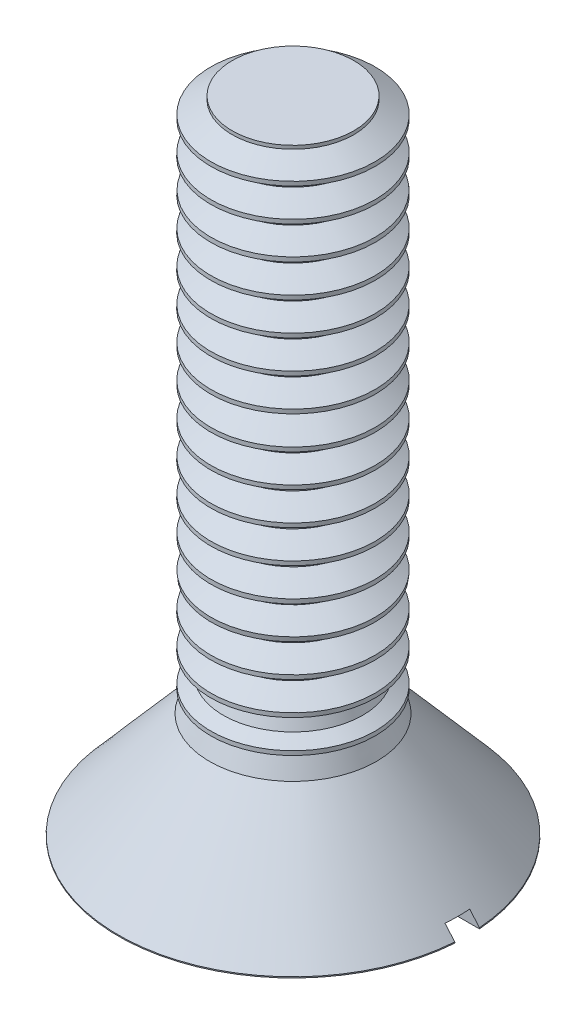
ISO-10303-21;
HEADER;
FILE_DESCRIPTION(('STEP AP214'),'2;1');
FILE_NAME('part.step','',(''),(''),'','','');
FILE_SCHEMA(('AUTOMOTIVE_DESIGN { 1 0 10303 214 1 1 1 1 }'));
ENDSEC;
DATA;
#1=APPLICATION_CONTEXT('core data for automotive mechanical design processes');
#2=APPLICATION_PROTOCOL_DEFINITION('international standard','automotive_design',2000,#1);
#3=PRODUCT_CONTEXT('',#1,'mechanical');
#4=PRODUCT('Part','Part','',(#3));
#5=PRODUCT_RELATED_PRODUCT_CATEGORY('part','',(#4));
#6=PRODUCT_DEFINITION_FORMATION('','',#4);
#7=PRODUCT_DEFINITION_CONTEXT('part definition',#1,'design');
#8=PRODUCT_DEFINITION('design','',#6,#7);
#9=PRODUCT_DEFINITION_SHAPE('','',#8);
#10=(LENGTH_UNIT() NAMED_UNIT(*) SI_UNIT(.MILLI.,.METRE.));
#11=(NAMED_UNIT(*) PLANE_ANGLE_UNIT() SI_UNIT($,.RADIAN.));
#12=(NAMED_UNIT(*) SI_UNIT($,.STERADIAN.) SOLID_ANGLE_UNIT());
#13=UNCERTAINTY_MEASURE_WITH_UNIT(LENGTH_MEASURE(1.E-05),#10,'distance_accuracy_value','');
#14=(GEOMETRIC_REPRESENTATION_CONTEXT(3) GLOBAL_UNCERTAINTY_ASSIGNED_CONTEXT((#13)) GLOBAL_UNIT_ASSIGNED_CONTEXT((#10,
#11,#12)) REPRESENTATION_CONTEXT('',''));
#15=CARTESIAN_POINT('',(0.,0.,0.));
#16=DIRECTION('',(0.,0.,1.));
#17=DIRECTION('',(1.,0.,0.));
#18=AXIS2_PLACEMENT_3D('',#15,#16,#17);
#19=CARTESIAN_POINT('',(-2.30362254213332,-0.786493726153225,0.));
#20=DIRECTION('',(0.,-1.,0.));
#21=DIRECTION('',(1.,0.,0.));
#22=AXIS2_PLACEMENT_3D('',#19,#20,#21);
#23=CYLINDRICAL_SURFACE('',#22,4.24853094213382);
#24=DIRECTION('',(0.,-1.,0.));
#25=VECTOR('',#24,1.);
#26=CARTESIAN_POINT('',(1.93430326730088,-0.786493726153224,-0.3));
#27=LINE('',#26,#25);
#28=CARTESIAN_POINT('',(1.93430326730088,0.0153919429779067,-0.3));
#29=VERTEX_POINT('',#28);
#30=CARTESIAN_POINT('',(1.93430326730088,0.0415998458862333,-0.3));
#31=VERTEX_POINT('',#30);
#32=EDGE_CURVE('E60',#29,#31,#27,.F.);
#33=ORIENTED_EDGE('',*,*,#32,.F.);
#34=CARTESIAN_POINT('',(-2.30362254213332,0.0153919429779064,0.));
#35=DIRECTION('',(0.,-1.,0.));
#36=DIRECTION('',(1.,0.,0.));
#37=AXIS2_PLACEMENT_3D('',#34,#35,#36);
#38=CIRCLE('',#37,4.24853094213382);
#39=CARTESIAN_POINT('',(-6.54154835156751,0.0153919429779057,-0.300000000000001));
#40=VERTEX_POINT('',#39);
#41=EDGE_CURVE('E108',#40,#29,#38,.T.);
#42=ORIENTED_EDGE('',*,*,#41,.F.);
#43=DIRECTION('',(0.,-1.,0.));
#44=VECTOR('',#43,1.);
#45=CARTESIAN_POINT('',(-6.54154835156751,-0.786493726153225,-0.300000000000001));
#46=LINE('',#45,#44);
#47=CARTESIAN_POINT('',(-6.54154835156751,0.0415998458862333,-0.300000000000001));
#48=VERTEX_POINT('',#47);
#49=EDGE_CURVE('E330',#48,#40,#46,.T.);
#50=ORIENTED_EDGE('',*,*,#49,.F.);
#51=CARTESIAN_POINT('',(-2.30362254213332,0.0415998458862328,0.));
#52=DIRECTION('',(0.,-1.,0.));
#53=DIRECTION('',(1.,0.,0.));
#54=AXIS2_PLACEMENT_3D('',#51,#52,#53);
#55=CIRCLE('',#54,4.24853094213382);
#56=EDGE_CURVE('E107',#48,#31,#55,.T.);
#57=ORIENTED_EDGE('',*,*,#56,.T.);
#58=EDGE_LOOP('',(#33,#42,#50,#57));
#59=FACE_BOUND('',#58,.T.);
#60=ADVANCED_FACE('F37',(#59),#23,.T.);
#61=CARTESIAN_POINT('',(0.,0.0153919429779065,0.));
#62=DIRECTION('',(0.,1.,0.));
#63=DIRECTION('',(-1.,0.,0.));
#64=AXIS2_PLACEMENT_3D('',#61,#62,#63);
#65=PLANE('',#64);
#66=ORIENTED_EDGE('',*,*,#41,.T.);
#67=DIRECTION('',(-1.,0.,0.));
#68=VECTOR('',#67,1.);
#69=CARTESIAN_POINT('',(0.,0.0153919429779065,-0.3));
#70=LINE('',#69,#68);
#71=EDGE_CURVE('E94',#29,#40,#70,.T.);
#72=ORIENTED_EDGE('',*,*,#71,.T.);
#73=EDGE_LOOP('',(#66,#72));
#74=FACE_BOUND('',#73,.T.);
#75=ADVANCED_FACE('F351',(#74),#65,.F.);
#76=CARTESIAN_POINT('',(-2.30362254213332,-0.786493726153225,0.));
#77=DIRECTION('',(0.,-1.,0.));
#78=DIRECTION('',(1.,0.,0.));
#79=AXIS2_PLACEMENT_3D('',#76,#77,#78);
#80=CYLINDRICAL_SURFACE('',#79,1.48056981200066);
#81=CARTESIAN_POINT('',(-2.30362254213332,15.6090098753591,0.));
#82=DIRECTION('',(0.,-1.,0.));
#83=DIRECTION('',(1.,0.,0.));
#84=AXIS2_PLACEMENT_3D('',#81,#82,#83);
#85=CIRCLE('',#84,1.48056981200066);
#86=CARTESIAN_POINT('',(-0.823052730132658,15.6090098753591,0.));
#87=VERTEX_POINT('',#86);
#88=EDGE_CURVE('E113',#87,#87,#85,.T.);
#89=ORIENTED_EDGE('',*,*,#88,.T.);
#90=EDGE_LOOP('',(#89));
#91=FACE_BOUND('',#90,.T.);
#92=CARTESIAN_POINT('',(-2.30362254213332,15.5256661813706,0.));
#93=DIRECTION('',(0.,-1.,0.));
#94=DIRECTION('',(1.,0.,0.));
#95=AXIS2_PLACEMENT_3D('',#92,#93,#94);
#96=CIRCLE('',#95,1.48056981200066);
#97=CARTESIAN_POINT('',(-0.823052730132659,15.5256661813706,0.));
#98=VERTEX_POINT('',#97);
#99=EDGE_CURVE('E95',#98,#98,#96,.T.);
#100=ORIENTED_EDGE('',*,*,#99,.F.);
#101=EDGE_LOOP('',(#100));
#102=FACE_BOUND('',#101,.T.);
#103=ADVANCED_FACE('F39',(#91,#102),#80,.T.);
#104=CARTESIAN_POINT('',(-2.30362254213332,15.2172921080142,0.));
#105=DIRECTION('',(0.,-1.,0.));
#106=DIRECTION('',(1.,0.,0.));
#107=AXIS2_PLACEMENT_3D('',#104,#105,#106);
#108=CONICAL_SURFACE('',#107,2.00024998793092,1.03524979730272);
#109=ORIENTED_EDGE('',*,*,#99,.T.);
#110=EDGE_LOOP('',(#109));
#111=FACE_BOUND('',#110,.T.);
#112=CARTESIAN_POINT('',(-2.30362254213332,15.2172921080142,0.));
#113=DIRECTION('',(0.,-1.,0.));
#114=DIRECTION('',(1.,0.,0.));
#115=AXIS2_PLACEMENT_3D('',#112,#113,#114);
#116=CIRCLE('',#115,2.00024998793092);
#117=CARTESIAN_POINT('',(-0.303372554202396,15.2172921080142,0.));
#118=VERTEX_POINT('',#117);
#119=EDGE_CURVE('E303',#118,#118,#116,.T.);
#120=ORIENTED_EDGE('',*,*,#119,.F.);
#121=EDGE_LOOP('',(#120));
#122=FACE_BOUND('',#121,.T.);
#123=ADVANCED_FACE('F1036',(#111,#122),#108,.T.);
#124=CARTESIAN_POINT('',(-2.30362254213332,-0.786493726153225,0.));
#125=DIRECTION('',(0.,-1.,0.));
#126=DIRECTION('',(1.,0.,0.));
#127=AXIS2_PLACEMENT_3D('',#124,#125,#126);
#128=CYLINDRICAL_SURFACE('',#127,2.00024998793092);
#129=ORIENTED_EDGE('',*,*,#119,.T.);
#130=EDGE_LOOP('',(#129));
#131=FACE_BOUND('',#130,.T.);
#132=CARTESIAN_POINT('',(-2.30362254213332,15.1172793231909,0.));
#133=DIRECTION('',(0.,-1.,0.));
#134=DIRECTION('',(1.,0.,0.));
#135=AXIS2_PLACEMENT_3D('',#132,#133,#134);
#136=CIRCLE('',#135,2.00024998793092);
#137=CARTESIAN_POINT('',(-0.303372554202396,15.1172793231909,0.));
#138=VERTEX_POINT('',#137);
#139=EDGE_CURVE('E300',#138,#138,#136,.T.);
#140=ORIENTED_EDGE('',*,*,#139,.F.);
#141=EDGE_LOOP('',(#140));
#142=FACE_BOUND('',#141,.T.);
#143=ADVANCED_FACE('F1026',(#131,#142),#128,.T.);
#144=CARTESIAN_POINT('',(-2.30362254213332,14.8089052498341,0.));
#145=DIRECTION('',(0.,1.,0.));
#146=DIRECTION('',(-1.,0.,0.));
#147=AXIS2_PLACEMENT_3D('',#144,#145,#146);
#148=CONICAL_SURFACE('',#147,1.48056981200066,1.03524979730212);
#149=ORIENTED_EDGE('',*,*,#139,.T.);
#150=EDGE_LOOP('',(#149));
#151=FACE_BOUND('',#150,.T.);
#152=CARTESIAN_POINT('',(-2.30362254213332,14.8089052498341,0.));
#153=DIRECTION('',(0.,-1.,0.));
#154=DIRECTION('',(1.,0.,0.));
#155=AXIS2_PLACEMENT_3D('',#152,#153,#154);
#156=CIRCLE('',#155,1.48056981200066);
#157=CARTESIAN_POINT('',(-0.823052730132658,14.8089052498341,0.));
#158=VERTEX_POINT('',#157);
#159=EDGE_CURVE('E297',#158,#158,#156,.T.);
#160=ORIENTED_EDGE('',*,*,#159,.F.);
#161=EDGE_LOOP('',(#160));
#162=FACE_BOUND('',#161,.T.);
#163=ADVANCED_FACE('F1016',(#151,#162),#148,.T.);
#164=CARTESIAN_POINT('',(-2.30362254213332,-0.786493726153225,0.));
#165=DIRECTION('',(0.,-1.,0.));
#166=DIRECTION('',(1.,0.,0.));
#167=AXIS2_PLACEMENT_3D('',#164,#165,#166);
#168=CYLINDRICAL_SURFACE('',#167,1.48056981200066);
#169=ORIENTED_EDGE('',*,*,#159,.T.);
#170=EDGE_LOOP('',(#169));
#171=FACE_BOUND('',#170,.T.);
#172=CARTESIAN_POINT('',(-2.30362254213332,14.7255662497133,0.));
#173=DIRECTION('',(0.,-1.,0.));
#174=DIRECTION('',(1.,0.,0.));
#175=AXIS2_PLACEMENT_3D('',#172,#173,#174);
#176=CIRCLE('',#175,1.48056981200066);
#177=CARTESIAN_POINT('',(-0.823052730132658,14.7255662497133,0.));
#178=VERTEX_POINT('',#177);
#179=EDGE_CURVE('E294',#178,#178,#176,.T.);
#180=ORIENTED_EDGE('',*,*,#179,.F.);
#181=EDGE_LOOP('',(#180));
#182=FACE_BOUND('',#181,.T.);
#183=ADVANCED_FACE('F1006',(#171,#182),#168,.T.);
#184=CARTESIAN_POINT('',(-2.30362254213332,14.4171921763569,0.));
#185=DIRECTION('',(0.,-1.,0.));
#186=DIRECTION('',(1.,0.,0.));
#187=AXIS2_PLACEMENT_3D('',#184,#185,#186);
#188=CONICAL_SURFACE('',#187,2.00024998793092,1.0352497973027);
#189=ORIENTED_EDGE('',*,*,#179,.T.);
#190=EDGE_LOOP('',(#189));
#191=FACE_BOUND('',#190,.T.);
#192=CARTESIAN_POINT('',(-2.30362254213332,14.4171921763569,0.));
#193=DIRECTION('',(0.,-1.,0.));
#194=DIRECTION('',(1.,0.,0.));
#195=AXIS2_PLACEMENT_3D('',#192,#193,#194);
#196=CIRCLE('',#195,2.00024998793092);
#197=CARTESIAN_POINT('',(-0.303372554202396,14.4171921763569,0.));
#198=VERTEX_POINT('',#197);
#199=EDGE_CURVE('E291',#198,#198,#196,.T.);
#200=ORIENTED_EDGE('',*,*,#199,.F.);
#201=EDGE_LOOP('',(#200));
#202=FACE_BOUND('',#201,.T.);
#203=ADVANCED_FACE('F996',(#191,#202),#188,.T.);
#204=CARTESIAN_POINT('',(-2.30362254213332,14.3170987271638,0.));
#205=DIRECTION('',(0.,-1.,0.));
#206=DIRECTION('',(1.,0.,0.));
#207=AXIS2_PLACEMENT_3D('',#204,#205,#206);
#208=CONICAL_SURFACE('',#207,2.00189807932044,0.0164640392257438);
#209=ORIENTED_EDGE('',*,*,#199,.T.);
#210=EDGE_LOOP('',(#209));
#211=FACE_BOUND('',#210,.T.);
#212=CARTESIAN_POINT('',(-2.30362254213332,14.3170987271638,0.));
#213=DIRECTION('',(0.,-1.,0.));
#214=DIRECTION('',(1.,0.,0.));
#215=AXIS2_PLACEMENT_3D('',#212,#213,#214);
#216=CIRCLE('',#215,2.00189807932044);
#217=CARTESIAN_POINT('',(-0.30172446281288,14.3170987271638,0.));
#218=VERTEX_POINT('',#217);
#219=EDGE_CURVE('E288',#218,#218,#216,.T.);
#220=ORIENTED_EDGE('',*,*,#219,.F.);
#221=EDGE_LOOP('',(#220));
#222=FACE_BOUND('',#221,.T.);
#223=ADVANCED_FACE('F986',(#211,#222),#208,.T.);
#224=CARTESIAN_POINT('',(-2.30362254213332,14.0088053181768,0.));
#225=DIRECTION('',(0.,1.,0.));
#226=DIRECTION('',(-1.,0.,0.));
#227=AXIS2_PLACEMENT_3D('',#224,#225,#226);
#228=CONICAL_SURFACE('',#227,1.48056981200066,1.03675295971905);
#229=ORIENTED_EDGE('',*,*,#219,.T.);
#230=EDGE_LOOP('',(#229));
#231=FACE_BOUND('',#230,.T.);
#232=CARTESIAN_POINT('',(-2.30362254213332,14.0088053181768,0.));
#233=DIRECTION('',(0.,-1.,0.));
#234=DIRECTION('',(1.,0.,0.));
#235=AXIS2_PLACEMENT_3D('',#232,#233,#234);
#236=CIRCLE('',#235,1.48056981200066);
#237=CARTESIAN_POINT('',(-0.823052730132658,14.0088053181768,0.));
#238=VERTEX_POINT('',#237);
#239=EDGE_CURVE('E285',#238,#238,#236,.T.);
#240=ORIENTED_EDGE('',*,*,#239,.F.);
#241=EDGE_LOOP('',(#240));
#242=FACE_BOUND('',#241,.T.);
#243=ADVANCED_FACE('F976',(#231,#242),#228,.T.);
#244=CARTESIAN_POINT('',(-2.30362254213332,-0.786493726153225,0.));
#245=DIRECTION('',(0.,-1.,0.));
#246=DIRECTION('',(1.,0.,0.));
#247=AXIS2_PLACEMENT_3D('',#244,#245,#246);
#248=CYLINDRICAL_SURFACE('',#247,1.48056981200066);
#249=ORIENTED_EDGE('',*,*,#239,.T.);
#250=EDGE_LOOP('',(#249));
#251=FACE_BOUND('',#250,.T.);
#252=CARTESIAN_POINT('',(-2.30362254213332,13.9254633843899,0.));
#253=DIRECTION('',(0.,-1.,0.));
#254=DIRECTION('',(1.,0.,0.));
#255=AXIS2_PLACEMENT_3D('',#252,#253,#254);
#256=CIRCLE('',#255,1.48056981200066);
#257=CARTESIAN_POINT('',(-0.823052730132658,13.9254633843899,0.));
#258=VERTEX_POINT('',#257);
#259=EDGE_CURVE('E282',#258,#258,#256,.T.);
#260=ORIENTED_EDGE('',*,*,#259,.F.);
#261=EDGE_LOOP('',(#260));
#262=FACE_BOUND('',#261,.T.);
#263=ADVANCED_FACE('F966',(#251,#262),#248,.T.);
#264=CARTESIAN_POINT('',(-2.30362254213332,13.6220161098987,0.));
#265=DIRECTION('',(0.,-1.,0.));
#266=DIRECTION('',(1.,0.,0.));
#267=AXIS2_PLACEMENT_3D('',#264,#265,#266);
#268=CONICAL_SURFACE('',#267,1.99677601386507,1.03936509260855);
#269=ORIENTED_EDGE('',*,*,#259,.T.);
#270=EDGE_LOOP('',(#269));
#271=FACE_BOUND('',#270,.T.);
#272=CARTESIAN_POINT('',(-2.30362254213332,13.6220161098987,0.));
#273=DIRECTION('',(0.,-1.,0.));
#274=DIRECTION('',(1.,0.,0.));
#275=AXIS2_PLACEMENT_3D('',#272,#273,#274);
#276=CIRCLE('',#275,1.99677601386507);
#277=CARTESIAN_POINT('',(-0.306846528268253,13.6220161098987,0.));
#278=VERTEX_POINT('',#277);
#279=EDGE_CURVE('E279',#278,#278,#276,.T.);
#280=ORIENTED_EDGE('',*,*,#279,.F.);
#281=EDGE_LOOP('',(#280));
#282=FACE_BOUND('',#281,.T.);
#283=ADVANCED_FACE('F956',(#271,#282),#268,.T.);
#284=CARTESIAN_POINT('',(-2.30362254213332,13.5169977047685,0.));
#285=DIRECTION('',(0.,-1.,0.));
#286=DIRECTION('',(1.,0.,0.));
#287=AXIS2_PLACEMENT_3D('',#284,#285,#286);
#288=CONICAL_SURFACE('',#287,2.00187905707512,0.0485537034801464);
#289=ORIENTED_EDGE('',*,*,#279,.T.);
#290=EDGE_LOOP('',(#289));
#291=FACE_BOUND('',#290,.T.);
#292=CARTESIAN_POINT('',(-2.30362254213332,13.5169977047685,0.));
#293=DIRECTION('',(0.,-1.,0.));
#294=DIRECTION('',(1.,0.,0.));
#295=AXIS2_PLACEMENT_3D('',#292,#293,#294);
#296=CIRCLE('',#295,2.00187905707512);
#297=CARTESIAN_POINT('',(-0.301743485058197,13.5169977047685,0.));
#298=VERTEX_POINT('',#297);
#299=EDGE_CURVE('E276',#298,#298,#296,.T.);
#300=ORIENTED_EDGE('',*,*,#299,.F.);
#301=EDGE_LOOP('',(#300));
#302=FACE_BOUND('',#301,.T.);
#303=ADVANCED_FACE('F946',(#291,#302),#288,.T.);
#304=CARTESIAN_POINT('',(-2.30362254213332,13.2087053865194,0.));
#305=DIRECTION('',(0.,1.,0.));
#306=DIRECTION('',(-1.,0.,0.));
#307=AXIS2_PLACEMENT_3D('',#304,#305,#306);
#308=CONICAL_SURFACE('',#307,1.48056981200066,1.03673852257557);
#309=ORIENTED_EDGE('',*,*,#299,.T.);
#310=EDGE_LOOP('',(#309));
#311=FACE_BOUND('',#310,.T.);
#312=CARTESIAN_POINT('',(-2.30362254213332,13.2087053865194,0.));
#313=DIRECTION('',(0.,-1.,0.));
#314=DIRECTION('',(1.,0.,0.));
#315=AXIS2_PLACEMENT_3D('',#312,#313,#314);
#316=CIRCLE('',#315,1.48056981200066);
#317=CARTESIAN_POINT('',(-0.823052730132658,13.2087053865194,0.));
#318=VERTEX_POINT('',#317);
#319=EDGE_CURVE('E273',#318,#318,#316,.T.);
#320=ORIENTED_EDGE('',*,*,#319,.F.);
#321=EDGE_LOOP('',(#320));
#322=FACE_BOUND('',#321,.T.);
#323=ADVANCED_FACE('F936',(#311,#322),#308,.T.);
#324=CARTESIAN_POINT('',(-2.30362254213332,-0.786493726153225,0.));
#325=DIRECTION('',(0.,-1.,0.));
#326=DIRECTION('',(1.,0.,0.));
#327=AXIS2_PLACEMENT_3D('',#324,#325,#326);
#328=CYLINDRICAL_SURFACE('',#327,1.48056981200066);
#329=ORIENTED_EDGE('',*,*,#319,.T.);
#330=EDGE_LOOP('',(#329));
#331=FACE_BOUND('',#330,.T.);
#332=CARTESIAN_POINT('',(-2.30362254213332,13.1253680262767,0.));
#333=DIRECTION('',(0.,-1.,0.));
#334=DIRECTION('',(1.,0.,0.));
#335=AXIS2_PLACEMENT_3D('',#332,#333,#334);
#336=CIRCLE('',#335,1.48056981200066);
#337=CARTESIAN_POINT('',(-0.823052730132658,13.1253680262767,0.));
#338=VERTEX_POINT('',#337);
#339=EDGE_CURVE('E270',#338,#338,#336,.T.);
#340=ORIENTED_EDGE('',*,*,#339,.F.);
#341=EDGE_LOOP('',(#340));
#342=FACE_BOUND('',#341,.T.);
#343=ADVANCED_FACE('F926',(#331,#342),#328,.T.);
#344=CARTESIAN_POINT('',(-2.30362254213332,12.8169917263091,0.));
#345=DIRECTION('',(0.,-1.,0.));
#346=DIRECTION('',(1.,0.,0.));
#347=AXIS2_PLACEMENT_3D('',#344,#345,#346);
#348=CONICAL_SURFACE('',#347,2.00024998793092,1.0352466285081);
#349=ORIENTED_EDGE('',*,*,#339,.T.);
#350=EDGE_LOOP('',(#349));
#351=FACE_BOUND('',#350,.T.);
#352=CARTESIAN_POINT('',(-2.30362254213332,12.8169917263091,0.));
#353=DIRECTION('',(0.,-1.,0.));
#354=DIRECTION('',(1.,0.,0.));
#355=AXIS2_PLACEMENT_3D('',#352,#353,#354);
#356=CIRCLE('',#355,2.00024998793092);
#357=CARTESIAN_POINT('',(-0.303372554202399,12.8169917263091,0.));
#358=VERTEX_POINT('',#357);
#359=EDGE_CURVE('E267',#358,#358,#356,.T.);
#360=ORIENTED_EDGE('',*,*,#359,.F.);
#361=EDGE_LOOP('',(#360));
#362=FACE_BOUND('',#361,.T.);
#363=ADVANCED_FACE('F916',(#351,#362),#348,.T.);
#364=CARTESIAN_POINT('',(-2.30362254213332,12.7168975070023,0.));
#365=DIRECTION('',(0.,-1.,0.));
#366=DIRECTION('',(1.,0.,0.));
#367=AXIS2_PLACEMENT_3D('',#364,#365,#366);
#368=CONICAL_SURFACE('',#367,2.00188038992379,0.0162872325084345);
#369=ORIENTED_EDGE('',*,*,#359,.T.);
#370=EDGE_LOOP('',(#369));
#371=FACE_BOUND('',#370,.T.);
#372=CARTESIAN_POINT('',(-2.30362254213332,12.7168975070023,0.));
#373=DIRECTION('',(0.,-1.,0.));
#374=DIRECTION('',(1.,0.,0.));
#375=AXIS2_PLACEMENT_3D('',#372,#373,#374);
#376=CIRCLE('',#375,2.00188038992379);
#377=CARTESIAN_POINT('',(-0.301742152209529,12.7168975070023,0.));
#378=VERTEX_POINT('',#377);
#379=EDGE_CURVE('E264',#378,#378,#376,.T.);
#380=ORIENTED_EDGE('',*,*,#379,.F.);
#381=EDGE_LOOP('',(#380));
#382=FACE_BOUND('',#381,.T.);
#383=ADVANCED_FACE('F906',(#371,#382),#368,.T.);
#384=CARTESIAN_POINT('',(-2.30362254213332,12.4086066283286,0.));
#385=DIRECTION('',(0.,1.,0.));
#386=DIRECTION('',(-1.,0.,0.));
#387=AXIS2_PLACEMENT_3D('',#384,#385,#386);
#388=CONICAL_SURFACE('',#387,1.48056981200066,1.03674168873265);
#389=ORIENTED_EDGE('',*,*,#379,.T.);
#390=EDGE_LOOP('',(#389));
#391=FACE_BOUND('',#390,.T.);
#392=CARTESIAN_POINT('',(-2.30362254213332,12.4086066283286,0.));
#393=DIRECTION('',(0.,-1.,0.));
#394=DIRECTION('',(1.,0.,0.));
#395=AXIS2_PLACEMENT_3D('',#392,#393,#394);
#396=CIRCLE('',#395,1.48056981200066);
#397=CARTESIAN_POINT('',(-0.823052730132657,12.4086066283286,0.));
#398=VERTEX_POINT('',#397);
#399=EDGE_CURVE('E261',#398,#398,#396,.T.);
#400=ORIENTED_EDGE('',*,*,#399,.F.);
#401=EDGE_LOOP('',(#400));
#402=FACE_BOUND('',#401,.T.);
#403=ADVANCED_FACE('F896',(#391,#402),#388,.T.);
#404=CARTESIAN_POINT('',(-2.30362254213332,-0.786493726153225,0.));
#405=DIRECTION('',(0.,-1.,0.));
#406=DIRECTION('',(1.,0.,0.));
#407=AXIS2_PLACEMENT_3D('',#404,#405,#406);
#408=CYLINDRICAL_SURFACE('',#407,1.48056981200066);
#409=ORIENTED_EDGE('',*,*,#399,.T.);
#410=EDGE_LOOP('',(#409));
#411=FACE_BOUND('',#410,.T.);
#412=CARTESIAN_POINT('',(-2.30362254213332,12.325265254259,0.));
#413=DIRECTION('',(0.,-1.,0.));
#414=DIRECTION('',(1.,0.,0.));
#415=AXIS2_PLACEMENT_3D('',#412,#413,#414);
#416=CIRCLE('',#415,1.48056981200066);
#417=CARTESIAN_POINT('',(-0.823052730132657,12.325265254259,0.));
#418=VERTEX_POINT('',#417);
#419=EDGE_CURVE('E258',#418,#418,#416,.T.);
#420=ORIENTED_EDGE('',*,*,#419,.F.);
#421=EDGE_LOOP('',(#420));
#422=FACE_BOUND('',#421,.T.);
#423=ADVANCED_FACE('F886',(#411,#422),#408,.T.);
#424=CARTESIAN_POINT('',(-2.30362254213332,12.0168917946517,0.));
#425=DIRECTION('',(0.,-1.,0.));
#426=DIRECTION('',(1.,0.,0.));
#427=AXIS2_PLACEMENT_3D('',#424,#425,#426);
#428=CONICAL_SURFACE('',#427,2.00024998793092,1.03525067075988);
#429=ORIENTED_EDGE('',*,*,#419,.T.);
#430=EDGE_LOOP('',(#429));
#431=FACE_BOUND('',#430,.T.);
#432=CARTESIAN_POINT('',(-2.30362254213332,12.0168917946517,0.));
#433=DIRECTION('',(0.,-1.,0.));
#434=DIRECTION('',(1.,0.,0.));
#435=AXIS2_PLACEMENT_3D('',#432,#433,#434);
#436=CIRCLE('',#435,2.00024998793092);
#437=CARTESIAN_POINT('',(-0.303372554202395,12.0168917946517,0.));
#438=VERTEX_POINT('',#437);
#439=EDGE_CURVE('E255',#438,#438,#436,.T.);
#440=ORIENTED_EDGE('',*,*,#439,.F.);
#441=EDGE_LOOP('',(#440));
#442=FACE_BOUND('',#441,.T.);
#443=ADVANCED_FACE('F876',(#431,#442),#428,.T.);
#444=CARTESIAN_POINT('',(-2.30362254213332,11.9167982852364,0.));
#445=DIRECTION('',(0.,-1.,0.));
#446=DIRECTION('',(1.,0.,0.));
#447=AXIS2_PLACEMENT_3D('',#444,#445,#446);
#448=CONICAL_SURFACE('',#447,2.00186347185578,0.0161183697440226);
#449=ORIENTED_EDGE('',*,*,#439,.T.);
#450=EDGE_LOOP('',(#449));
#451=FACE_BOUND('',#450,.T.);
#452=CARTESIAN_POINT('',(-2.30362254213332,11.9167982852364,0.));
#453=DIRECTION('',(0.,-1.,0.));
#454=DIRECTION('',(1.,0.,0.));
#455=AXIS2_PLACEMENT_3D('',#452,#453,#454);
#456=CIRCLE('',#455,2.00186347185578);
#457=CARTESIAN_POINT('',(-0.301759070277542,11.9167982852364,0.));
#458=VERTEX_POINT('',#457);
#459=EDGE_CURVE('E252',#458,#458,#456,.T.);
#460=ORIENTED_EDGE('',*,*,#459,.F.);
#461=EDGE_LOOP('',(#460));
#462=FACE_BOUND('',#461,.T.);
#463=ADVANCED_FACE('F866',(#451,#462),#448,.T.);
#464=CARTESIAN_POINT('',(-2.30362254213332,11.6085031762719,0.));
#465=DIRECTION('',(0.,1.,0.));
#466=DIRECTION('',(-1.,0.,0.));
#467=AXIS2_PLACEMENT_3D('',#464,#465,#466);
#468=CONICAL_SURFACE('',#467,1.48056981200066,1.03672145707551);
#469=ORIENTED_EDGE('',*,*,#459,.T.);
#470=EDGE_LOOP('',(#469));
#471=FACE_BOUND('',#470,.T.);
#472=CARTESIAN_POINT('',(-2.30362254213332,11.6085031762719,0.));
#473=DIRECTION('',(0.,-1.,0.));
#474=DIRECTION('',(1.,0.,0.));
#475=AXIS2_PLACEMENT_3D('',#472,#473,#474);
#476=CIRCLE('',#475,1.48056981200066);
#477=CARTESIAN_POINT('',(-0.823052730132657,11.6085031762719,0.));
#478=VERTEX_POINT('',#477);
#479=EDGE_CURVE('E249',#478,#478,#476,.T.);
#480=ORIENTED_EDGE('',*,*,#479,.F.);
#481=EDGE_LOOP('',(#480));
#482=FACE_BOUND('',#481,.T.);
#483=ADVANCED_FACE('F856',(#471,#482),#468,.T.);
#484=CARTESIAN_POINT('',(-2.30362254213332,-0.786493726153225,0.));
#485=DIRECTION('',(0.,-1.,0.));
#486=DIRECTION('',(1.,0.,0.));
#487=AXIS2_PLACEMENT_3D('',#484,#485,#486);
#488=CYLINDRICAL_SURFACE('',#487,1.48056981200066);
#489=ORIENTED_EDGE('',*,*,#479,.T.);
#490=EDGE_LOOP('',(#489));
#491=FACE_BOUND('',#490,.T.);
#492=CARTESIAN_POINT('',(-2.30362254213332,11.5251659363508,0.));
#493=DIRECTION('',(0.,-1.,0.));
#494=DIRECTION('',(1.,0.,0.));
#495=AXIS2_PLACEMENT_3D('',#492,#493,#494);
#496=CIRCLE('',#495,1.48056981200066);
#497=CARTESIAN_POINT('',(-0.823052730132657,11.5251659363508,0.));
#498=VERTEX_POINT('',#497);
#499=EDGE_CURVE('E246',#498,#498,#496,.T.);
#500=ORIENTED_EDGE('',*,*,#499,.F.);
#501=EDGE_LOOP('',(#500));
#502=FACE_BOUND('',#501,.T.);
#503=ADVANCED_FACE('F846',(#491,#502),#488,.T.);
#504=CARTESIAN_POINT('',(-2.30362254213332,11.2167918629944,0.));
#505=DIRECTION('',(0.,-1.,0.));
#506=DIRECTION('',(1.,0.,0.));
#507=AXIS2_PLACEMENT_3D('',#504,#505,#506);
#508=CONICAL_SURFACE('',#507,2.00024998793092,1.03524979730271);
#509=ORIENTED_EDGE('',*,*,#499,.T.);
#510=EDGE_LOOP('',(#509));
#511=FACE_BOUND('',#510,.T.);
#512=CARTESIAN_POINT('',(-2.30362254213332,11.2167918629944,0.));
#513=DIRECTION('',(0.,-1.,0.));
#514=DIRECTION('',(1.,0.,0.));
#515=AXIS2_PLACEMENT_3D('',#512,#513,#514);
#516=CIRCLE('',#515,2.00024998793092);
#517=CARTESIAN_POINT('',(-0.303372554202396,11.2167918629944,0.));
#518=VERTEX_POINT('',#517);
#519=EDGE_CURVE('E243',#518,#518,#516,.T.);
#520=ORIENTED_EDGE('',*,*,#519,.F.);
#521=EDGE_LOOP('',(#520));
#522=FACE_BOUND('',#521,.T.);
#523=ADVANCED_FACE('F836',(#511,#522),#508,.T.);
#524=CARTESIAN_POINT('',(-2.30362254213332,11.116698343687,0.));
#525=DIRECTION('',(0.,-1.,0.));
#526=DIRECTION('',(1.,0.,0.));
#527=AXIS2_PLACEMENT_3D('',#524,#525,#526);
#528=CONICAL_SURFACE('',#527,2.00187146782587,0.0161982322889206);
#529=ORIENTED_EDGE('',*,*,#519,.T.);
#530=EDGE_LOOP('',(#529));
#531=FACE_BOUND('',#530,.T.);
#532=CARTESIAN_POINT('',(-2.30362254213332,11.116698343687,0.));
#533=DIRECTION('',(0.,-1.,0.));
#534=DIRECTION('',(1.,0.,0.));
#535=AXIS2_PLACEMENT_3D('',#532,#533,#534);
#536=CIRCLE('',#535,2.00187146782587);
#537=CARTESIAN_POINT('',(-0.301751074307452,11.116698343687,0.));
#538=VERTEX_POINT('',#537);
#539=EDGE_CURVE('E240',#538,#538,#536,.T.);
#540=ORIENTED_EDGE('',*,*,#539,.F.);
#541=EDGE_LOOP('',(#540));
#542=FACE_BOUND('',#541,.T.);
#543=ADVANCED_FACE('F826',(#531,#542),#528,.T.);
#544=CARTESIAN_POINT('',(-2.30362254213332,10.8084055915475,0.));
#545=DIRECTION('',(0.,1.,0.));
#546=DIRECTION('',(-1.,0.,0.));
#547=AXIS2_PLACEMENT_3D('',#544,#545,#546);
#548=CONICAL_SURFACE('',#547,1.48056981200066,1.03673152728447);
#549=ORIENTED_EDGE('',*,*,#539,.T.);
#550=EDGE_LOOP('',(#549));
#551=FACE_BOUND('',#550,.T.);
#552=CARTESIAN_POINT('',(-2.30362254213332,10.8084055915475,0.));
#553=DIRECTION('',(0.,-1.,0.));
#554=DIRECTION('',(1.,0.,0.));
#555=AXIS2_PLACEMENT_3D('',#552,#553,#554);
#556=CIRCLE('',#555,1.48056981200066);
#557=CARTESIAN_POINT('',(-0.823052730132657,10.8084055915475,0.));
#558=VERTEX_POINT('',#557);
#559=EDGE_CURVE('E237',#558,#558,#556,.T.);
#560=ORIENTED_EDGE('',*,*,#559,.F.);
#561=EDGE_LOOP('',(#560));
#562=FACE_BOUND('',#561,.T.);
#563=ADVANCED_FACE('F816',(#551,#562),#548,.T.);
#564=CARTESIAN_POINT('',(-2.30362254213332,-0.786493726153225,0.));
#565=DIRECTION('',(0.,-1.,0.));
#566=DIRECTION('',(1.,0.,0.));
#567=AXIS2_PLACEMENT_3D('',#564,#565,#566);
#568=CYLINDRICAL_SURFACE('',#567,1.48056981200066);
#569=ORIENTED_EDGE('',*,*,#559,.T.);
#570=EDGE_LOOP('',(#569));
#571=FACE_BOUND('',#570,.T.);
#572=CARTESIAN_POINT('',(-2.30362254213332,10.7250660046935,0.));
#573=DIRECTION('',(0.,-1.,0.));
#574=DIRECTION('',(1.,0.,0.));
#575=AXIS2_PLACEMENT_3D('',#572,#573,#574);
#576=CIRCLE('',#575,1.48056981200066);
#577=CARTESIAN_POINT('',(-0.823052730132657,10.7250660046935,0.));
#578=VERTEX_POINT('',#577);
#579=EDGE_CURVE('E234',#578,#578,#576,.T.);
#580=ORIENTED_EDGE('',*,*,#579,.F.);
#581=EDGE_LOOP('',(#580));
#582=FACE_BOUND('',#581,.T.);
#583=ADVANCED_FACE('F806',(#571,#582),#568,.T.);
#584=CARTESIAN_POINT('',(-2.30362254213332,10.4166919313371,0.));
#585=DIRECTION('',(0.,-1.,0.));
#586=DIRECTION('',(1.,0.,0.));
#587=AXIS2_PLACEMENT_3D('',#584,#585,#586);
#588=CONICAL_SURFACE('',#587,2.00024998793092,1.03524979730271);
#589=ORIENTED_EDGE('',*,*,#579,.T.);
#590=EDGE_LOOP('',(#589));
#591=FACE_BOUND('',#590,.T.);
#592=CARTESIAN_POINT('',(-2.30362254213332,10.4166919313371,0.));
#593=DIRECTION('',(0.,-1.,0.));
#594=DIRECTION('',(1.,0.,0.));
#595=AXIS2_PLACEMENT_3D('',#592,#593,#594);
#596=CIRCLE('',#595,2.00024998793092);
#597=CARTESIAN_POINT('',(-0.303372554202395,10.4166919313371,0.));
#598=VERTEX_POINT('',#597);
#599=EDGE_CURVE('E231',#598,#598,#596,.T.);
#600=ORIENTED_EDGE('',*,*,#599,.F.);
#601=EDGE_LOOP('',(#600));
#602=FACE_BOUND('',#601,.T.);
#603=ADVANCED_FACE('F796',(#591,#602),#588,.T.);
#604=CARTESIAN_POINT('',(-2.30362254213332,10.3155573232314,0.));
#605=DIRECTION('',(0.,-1.,0.));
#606=DIRECTION('',(1.,0.,0.));
#607=AXIS2_PLACEMENT_3D('',#604,#605,#606);
#608=CONICAL_SURFACE('',#607,2.00032498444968,0.000741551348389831);
#609=ORIENTED_EDGE('',*,*,#599,.T.);
#610=EDGE_LOOP('',(#609));
#611=FACE_BOUND('',#610,.T.);
#612=CARTESIAN_POINT('',(-2.30362254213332,10.3155573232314,0.));
#613=DIRECTION('',(0.,-1.,0.));
#614=DIRECTION('',(1.,0.,0.));
#615=AXIS2_PLACEMENT_3D('',#612,#613,#614);
#616=CIRCLE('',#615,2.00032498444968);
#617=CARTESIAN_POINT('',(-0.303297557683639,10.3155573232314,0.));
#618=VERTEX_POINT('',#617);
#619=EDGE_CURVE('E228',#618,#618,#616,.T.);
#620=ORIENTED_EDGE('',*,*,#619,.F.);
#621=EDGE_LOOP('',(#620));
#622=FACE_BOUND('',#621,.T.);
#623=ADVANCED_FACE('F786',(#611,#622),#608,.T.);
#624=CARTESIAN_POINT('',(-2.30362254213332,10.0083033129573,0.));
#625=DIRECTION('',(0.,1.,0.));
#626=DIRECTION('',(-1.,0.,0.));
#627=AXIS2_PLACEMENT_3D('',#624,#625,#626);
#628=CONICAL_SURFACE('',#627,1.48056981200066,1.03690853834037);
#629=ORIENTED_EDGE('',*,*,#619,.T.);
#630=EDGE_LOOP('',(#629));
#631=FACE_BOUND('',#630,.T.);
#632=CARTESIAN_POINT('',(-2.30362254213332,10.0083033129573,0.));
#633=DIRECTION('',(0.,-1.,0.));
#634=DIRECTION('',(1.,0.,0.));
#635=AXIS2_PLACEMENT_3D('',#632,#633,#634);
#636=CIRCLE('',#635,1.48056981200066);
#637=CARTESIAN_POINT('',(-0.823052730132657,10.0083033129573,0.));
#638=VERTEX_POINT('',#637);
#639=EDGE_CURVE('E225',#638,#638,#636,.T.);
#640=ORIENTED_EDGE('',*,*,#639,.F.);
#641=EDGE_LOOP('',(#640));
#642=FACE_BOUND('',#641,.T.);
#643=ADVANCED_FACE('F776',(#631,#642),#628,.T.);
#644=CARTESIAN_POINT('',(-2.30362254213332,9.61659199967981,0.));
#645=DIRECTION('',(0.,-1.,0.));
#646=DIRECTION('',(1.,0.,0.));
#647=AXIS2_PLACEMENT_3D('',#644,#645,#646);
#648=CONICAL_SURFACE('',#647,2.00024998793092,0.924896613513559);
#649=ORIENTED_EDGE('',*,*,#639,.T.);
#650=EDGE_LOOP('',(#649));
#651=FACE_BOUND('',#650,.T.);
#652=CARTESIAN_POINT('',(-2.30362254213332,9.61659199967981,0.));
#653=DIRECTION('',(0.,-1.,0.));
#654=DIRECTION('',(1.,0.,0.));
#655=AXIS2_PLACEMENT_3D('',#652,#653,#654);
#656=CIRCLE('',#655,2.00024998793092);
#657=CARTESIAN_POINT('',(-0.303372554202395,9.61659199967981,0.));
#658=VERTEX_POINT('',#657);
#659=EDGE_CURVE('E222',#658,#658,#656,.T.);
#660=ORIENTED_EDGE('',*,*,#659,.F.);
#661=EDGE_LOOP('',(#660));
#662=FACE_BOUND('',#661,.T.);
#663=ADVANCED_FACE('F766',(#651,#662),#648,.T.);
#664=CARTESIAN_POINT('',(-2.30362254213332,-0.786493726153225,0.));
#665=DIRECTION('',(0.,-1.,0.));
#666=DIRECTION('',(1.,0.,0.));
#667=AXIS2_PLACEMENT_3D('',#664,#665,#666);
#668=CYLINDRICAL_SURFACE('',#667,2.00024998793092);
#669=ORIENTED_EDGE('',*,*,#659,.T.);
#670=EDGE_LOOP('',(#669));
#671=FACE_BOUND('',#670,.T.);
#672=CARTESIAN_POINT('',(-2.30362254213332,9.5144191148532,0.));
#673=DIRECTION('',(0.,-1.,0.));
#674=DIRECTION('',(1.,0.,0.));
#675=AXIS2_PLACEMENT_3D('',#672,#673,#674);
#676=CIRCLE('',#675,2.00024998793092);
#677=CARTESIAN_POINT('',(-0.303372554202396,9.5144191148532,0.));
#678=VERTEX_POINT('',#677);
#679=EDGE_CURVE('E219',#678,#678,#676,.T.);
#680=ORIENTED_EDGE('',*,*,#679,.F.);
#681=EDGE_LOOP('',(#680));
#682=FACE_BOUND('',#681,.T.);
#683=ADVANCED_FACE('F756',(#671,#682),#668,.T.);
#684=CARTESIAN_POINT('',(-2.30362254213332,9.20820572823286,0.));
#685=DIRECTION('',(0.,1.,0.));
#686=DIRECTION('',(-1.,0.,0.));
#687=AXIS2_PLACEMENT_3D('',#684,#685,#686);
#688=CONICAL_SURFACE('',#687,1.48056981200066,1.03833038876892);
#689=ORIENTED_EDGE('',*,*,#679,.T.);
#690=EDGE_LOOP('',(#689));
#691=FACE_BOUND('',#690,.T.);
#692=CARTESIAN_POINT('',(-2.30362254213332,9.20820572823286,0.));
#693=DIRECTION('',(0.,-1.,0.));
#694=DIRECTION('',(1.,0.,0.));
#695=AXIS2_PLACEMENT_3D('',#692,#693,#694);
#696=CIRCLE('',#695,1.48056981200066);
#697=CARTESIAN_POINT('',(-0.823052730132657,9.20820572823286,0.));
#698=VERTEX_POINT('',#697);
#699=EDGE_CURVE('E216',#698,#698,#696,.T.);
#700=ORIENTED_EDGE('',*,*,#699,.F.);
#701=EDGE_LOOP('',(#700));
#702=FACE_BOUND('',#701,.T.);
#703=ADVANCED_FACE('F746',(#691,#702),#688,.T.);
#704=CARTESIAN_POINT('',(-2.30362254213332,-0.786493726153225,0.));
#705=DIRECTION('',(0.,-1.,0.));
#706=DIRECTION('',(1.,0.,0.));
#707=AXIS2_PLACEMENT_3D('',#704,#705,#706);
#708=CYLINDRICAL_SURFACE('',#707,1.48056981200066);
#709=ORIENTED_EDGE('',*,*,#699,.T.);
#710=EDGE_LOOP('',(#709));
#711=FACE_BOUND('',#710,.T.);
#712=CARTESIAN_POINT('',(-2.30362254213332,9.12485792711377,0.));
#713=DIRECTION('',(0.,-1.,0.));
#714=DIRECTION('',(1.,0.,0.));
#715=AXIS2_PLACEMENT_3D('',#712,#713,#714);
#716=CIRCLE('',#715,1.48056981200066);
#717=CARTESIAN_POINT('',(-0.823052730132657,9.12485792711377,0.));
#718=VERTEX_POINT('',#717);
#719=EDGE_CURVE('E213',#718,#718,#716,.T.);
#720=ORIENTED_EDGE('',*,*,#719,.F.);
#721=EDGE_LOOP('',(#720));
#722=FACE_BOUND('',#721,.T.);
#723=ADVANCED_FACE('F736',(#711,#722),#708,.T.);
#724=CARTESIAN_POINT('',(-2.30362254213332,8.81649206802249,0.));
#725=DIRECTION('',(0.,-1.,0.));
#726=DIRECTION('',(1.,0.,0.));
#727=AXIS2_PLACEMENT_3D('',#724,#725,#726);
#728=CONICAL_SURFACE('',#727,2.00024998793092,1.03526148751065);
#729=ORIENTED_EDGE('',*,*,#719,.T.);
#730=EDGE_LOOP('',(#729));
#731=FACE_BOUND('',#730,.T.);
#732=CARTESIAN_POINT('',(-2.30362254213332,8.81649206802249,0.));
#733=DIRECTION('',(0.,-1.,0.));
#734=DIRECTION('',(1.,0.,0.));
#735=AXIS2_PLACEMENT_3D('',#732,#733,#734);
#736=CIRCLE('',#735,2.00024998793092);
#737=CARTESIAN_POINT('',(-0.303372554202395,8.81649206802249,0.));
#738=VERTEX_POINT('',#737);
#739=EDGE_CURVE('E210',#738,#738,#736,.T.);
#740=ORIENTED_EDGE('',*,*,#739,.F.);
#741=EDGE_LOOP('',(#740));
#742=FACE_BOUND('',#741,.T.);
#743=ADVANCED_FACE('F726',(#731,#742),#728,.T.);
#744=CARTESIAN_POINT('',(-2.30362254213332,-0.786493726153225,0.));
#745=DIRECTION('',(0.,-1.,0.));
#746=DIRECTION('',(1.,0.,0.));
#747=AXIS2_PLACEMENT_3D('',#744,#745,#746);
#748=CYLINDRICAL_SURFACE('',#747,2.00024998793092);
#749=ORIENTED_EDGE('',*,*,#739,.T.);
#750=EDGE_LOOP('',(#749));
#751=FACE_BOUND('',#750,.T.);
#752=CARTESIAN_POINT('',(-2.30362254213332,8.71647986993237,0.));
#753=DIRECTION('',(0.,-1.,0.));
#754=DIRECTION('',(1.,0.,0.));
#755=AXIS2_PLACEMENT_3D('',#752,#753,#754);
#756=CIRCLE('',#755,2.00024998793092);
#757=CARTESIAN_POINT('',(-0.303372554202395,8.71647986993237,0.));
#758=VERTEX_POINT('',#757);
#759=EDGE_CURVE('E207',#758,#758,#756,.T.);
#760=ORIENTED_EDGE('',*,*,#759,.F.);
#761=EDGE_LOOP('',(#760));
#762=FACE_BOUND('',#761,.T.);
#763=ADVANCED_FACE('F716',(#751,#762),#748,.T.);
#764=CARTESIAN_POINT('',(-2.30362254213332,8.40810579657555,0.));
#765=DIRECTION('',(0.,1.,0.));
#766=DIRECTION('',(-1.,0.,0.));
#767=AXIS2_PLACEMENT_3D('',#764,#765,#766);
#768=CONICAL_SURFACE('',#767,1.48056981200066,1.03524979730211);
#769=ORIENTED_EDGE('',*,*,#759,.T.);
#770=EDGE_LOOP('',(#769));
#771=FACE_BOUND('',#770,.T.);
#772=CARTESIAN_POINT('',(-2.30362254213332,8.40810579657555,0.));
#773=DIRECTION('',(0.,-1.,0.));
#774=DIRECTION('',(1.,0.,0.));
#775=AXIS2_PLACEMENT_3D('',#772,#773,#774);
#776=CIRCLE('',#775,1.48056981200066);
#777=CARTESIAN_POINT('',(-0.823052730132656,8.40810579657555,0.));
#778=VERTEX_POINT('',#777);
#779=EDGE_CURVE('E204',#778,#778,#776,.T.);
#780=ORIENTED_EDGE('',*,*,#779,.F.);
#781=EDGE_LOOP('',(#780));
#782=FACE_BOUND('',#781,.T.);
#783=ADVANCED_FACE('F706',(#771,#782),#768,.T.);
#784=CARTESIAN_POINT('',(-2.30362254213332,-0.786493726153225,0.));
#785=DIRECTION('',(0.,-1.,0.));
#786=DIRECTION('',(1.,0.,0.));
#787=AXIS2_PLACEMENT_3D('',#784,#785,#786);
#788=CYLINDRICAL_SURFACE('',#787,1.48056981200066);
#789=ORIENTED_EDGE('',*,*,#779,.T.);
#790=EDGE_LOOP('',(#789));
#791=FACE_BOUND('',#790,.T.);
#792=CARTESIAN_POINT('',(-2.30362254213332,8.32476620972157,0.));
#793=DIRECTION('',(0.,-1.,0.));
#794=DIRECTION('',(1.,0.,0.));
#795=AXIS2_PLACEMENT_3D('',#792,#793,#794);
#796=CIRCLE('',#795,1.48056981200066);
#797=CARTESIAN_POINT('',(-0.823052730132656,8.32476620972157,0.));
#798=VERTEX_POINT('',#797);
#799=EDGE_CURVE('E201',#798,#798,#796,.T.);
#800=ORIENTED_EDGE('',*,*,#799,.F.);
#801=EDGE_LOOP('',(#800));
#802=FACE_BOUND('',#801,.T.);
#803=ADVANCED_FACE('F696',(#791,#802),#788,.T.);
#804=CARTESIAN_POINT('',(-2.30362254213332,8.01639213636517,0.));
#805=DIRECTION('',(0.,-1.,0.));
#806=DIRECTION('',(1.,0.,0.));
#807=AXIS2_PLACEMENT_3D('',#804,#805,#806);
#808=CONICAL_SURFACE('',#807,2.00024998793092,1.0352497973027);
#809=ORIENTED_EDGE('',*,*,#799,.T.);
#810=EDGE_LOOP('',(#809));
#811=FACE_BOUND('',#810,.T.);
#812=CARTESIAN_POINT('',(-2.30362254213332,8.01639213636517,0.));
#813=DIRECTION('',(0.,-1.,0.));
#814=DIRECTION('',(1.,0.,0.));
#815=AXIS2_PLACEMENT_3D('',#812,#813,#814);
#816=CIRCLE('',#815,2.00024998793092);
#817=CARTESIAN_POINT('',(-0.303372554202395,8.01639213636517,0.));
#818=VERTEX_POINT('',#817);
#819=EDGE_CURVE('E198',#818,#818,#816,.T.);
#820=ORIENTED_EDGE('',*,*,#819,.F.);
#821=EDGE_LOOP('',(#820));
#822=FACE_BOUND('',#821,.T.);
#823=ADVANCED_FACE('F686',(#811,#822),#808,.T.);
#824=CARTESIAN_POINT('',(-2.30362254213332,7.91629854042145,0.));
#825=DIRECTION('',(0.,-1.,0.));
#826=DIRECTION('',(1.,0.,0.));
#827=AXIS2_PLACEMENT_3D('',#824,#825,#826);
#828=CONICAL_SURFACE('',#827,2.00187781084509,0.0162615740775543);
#829=ORIENTED_EDGE('',*,*,#819,.T.);
#830=EDGE_LOOP('',(#829));
#831=FACE_BOUND('',#830,.T.);
#832=CARTESIAN_POINT('',(-2.30362254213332,7.91629854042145,0.));
#833=DIRECTION('',(0.,-1.,0.));
#834=DIRECTION('',(1.,0.,0.));
#835=AXIS2_PLACEMENT_3D('',#832,#833,#834);
#836=CIRCLE('',#835,2.00187781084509);
#837=CARTESIAN_POINT('',(-0.30174473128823,7.91629854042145,0.));
#838=VERTEX_POINT('',#837);
#839=EDGE_CURVE('E195',#838,#838,#836,.T.);
#840=ORIENTED_EDGE('',*,*,#839,.F.);
#841=EDGE_LOOP('',(#840));
#842=FACE_BOUND('',#841,.T.);
#843=ADVANCED_FACE('F676',(#831,#842),#828,.T.);
#844=CARTESIAN_POINT('',(-2.30362254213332,7.60800586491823,0.));
#845=DIRECTION('',(0.,1.,0.));
#846=DIRECTION('',(-1.,0.,0.));
#847=AXIS2_PLACEMENT_3D('',#844,#845,#846);
#848=CONICAL_SURFACE('',#847,1.48056981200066,1.03673696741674);
#849=ORIENTED_EDGE('',*,*,#839,.T.);
#850=EDGE_LOOP('',(#849));
#851=FACE_BOUND('',#850,.T.);
#852=CARTESIAN_POINT('',(-2.30362254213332,7.60800586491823,0.));
#853=DIRECTION('',(0.,-1.,0.));
#854=DIRECTION('',(1.,0.,0.));
#855=AXIS2_PLACEMENT_3D('',#852,#853,#854);
#856=CIRCLE('',#855,1.48056981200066);
#857=CARTESIAN_POINT('',(-0.823052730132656,7.60800586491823,0.));
#858=VERTEX_POINT('',#857);
#859=EDGE_CURVE('E192',#858,#858,#856,.T.);
#860=ORIENTED_EDGE('',*,*,#859,.F.);
#861=EDGE_LOOP('',(#860));
#862=FACE_BOUND('',#861,.T.);
#863=ADVANCED_FACE('F666',(#851,#862),#848,.T.);
#864=CARTESIAN_POINT('',(-2.30362254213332,-0.786493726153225,0.));
#865=DIRECTION('',(0.,-1.,0.));
#866=DIRECTION('',(1.,0.,0.));
#867=AXIS2_PLACEMENT_3D('',#864,#865,#866);
#868=CYLINDRICAL_SURFACE('',#867,1.48056981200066);
#869=ORIENTED_EDGE('',*,*,#859,.T.);
#870=EDGE_LOOP('',(#869));
#871=FACE_BOUND('',#870,.T.);
#872=CARTESIAN_POINT('',(-2.30362254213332,7.52466627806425,0.));
#873=DIRECTION('',(0.,-1.,0.));
#874=DIRECTION('',(1.,0.,0.));
#875=AXIS2_PLACEMENT_3D('',#872,#873,#874);
#876=CIRCLE('',#875,1.48056981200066);
#877=CARTESIAN_POINT('',(-0.823052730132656,7.52466627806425,0.));
#878=VERTEX_POINT('',#877);
#879=EDGE_CURVE('E189',#878,#878,#876,.T.);
#880=ORIENTED_EDGE('',*,*,#879,.F.);
#881=EDGE_LOOP('',(#880));
#882=FACE_BOUND('',#881,.T.);
#883=ADVANCED_FACE('F656',(#871,#882),#868,.T.);
#884=CARTESIAN_POINT('',(-2.30362254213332,7.21629220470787,0.));
#885=DIRECTION('',(0.,-1.,0.));
#886=DIRECTION('',(1.,0.,0.));
#887=AXIS2_PLACEMENT_3D('',#884,#885,#886);
#888=CONICAL_SURFACE('',#887,2.00024998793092,1.03524979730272);
#889=ORIENTED_EDGE('',*,*,#879,.T.);
#890=EDGE_LOOP('',(#889));
#891=FACE_BOUND('',#890,.T.);
#892=CARTESIAN_POINT('',(-2.30362254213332,7.21629220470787,0.));
#893=DIRECTION('',(0.,-1.,0.));
#894=DIRECTION('',(1.,0.,0.));
#895=AXIS2_PLACEMENT_3D('',#892,#893,#894);
#896=CIRCLE('',#895,2.00024998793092);
#897=CARTESIAN_POINT('',(-0.303372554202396,7.21629220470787,0.));
#898=VERTEX_POINT('',#897);
#899=EDGE_CURVE('E186',#898,#898,#896,.T.);
#900=ORIENTED_EDGE('',*,*,#899,.F.);
#901=EDGE_LOOP('',(#900));
#902=FACE_BOUND('',#901,.T.);
#903=ADVANCED_FACE('F646',(#891,#902),#888,.T.);
#904=CARTESIAN_POINT('',(-2.30362254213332,7.11619936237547,0.));
#905=DIRECTION('',(0.,-1.,0.));
#906=DIRECTION('',(1.,0.,0.));
#907=AXIS2_PLACEMENT_3D('',#904,#905,#906);
#908=CONICAL_SURFACE('',#907,2.001882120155,0.0163047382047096);
#909=ORIENTED_EDGE('',*,*,#899,.T.);
#910=EDGE_LOOP('',(#909));
#911=FACE_BOUND('',#910,.T.);
#912=CARTESIAN_POINT('',(-2.30362254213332,7.11619936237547,0.));
#913=DIRECTION('',(0.,-1.,0.));
#914=DIRECTION('',(1.,0.,0.));
#915=AXIS2_PLACEMENT_3D('',#912,#913,#914);
#916=CIRCLE('',#915,2.001882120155);
#917=CARTESIAN_POINT('',(-0.301740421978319,7.11619936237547,0.));
#918=VERTEX_POINT('',#917);
#919=EDGE_CURVE('E183',#918,#918,#916,.T.);
#920=ORIENTED_EDGE('',*,*,#919,.F.);
#921=EDGE_LOOP('',(#920));
#922=FACE_BOUND('',#921,.T.);
#923=ADVANCED_FACE('F636',(#911,#922),#908,.T.);
#924=CARTESIAN_POINT('',(-2.30362254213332,6.80790593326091,0.));
#925=DIRECTION('',(0.,1.,0.));
#926=DIRECTION('',(-1.,0.,0.));
#927=AXIS2_PLACEMENT_3D('',#924,#925,#926);
#928=CONICAL_SURFACE('',#927,1.48056981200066,1.0367395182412);
#929=ORIENTED_EDGE('',*,*,#919,.T.);
#930=EDGE_LOOP('',(#929));
#931=FACE_BOUND('',#930,.T.);
#932=CARTESIAN_POINT('',(-2.30362254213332,6.80790593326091,0.));
#933=DIRECTION('',(0.,-1.,0.));
#934=DIRECTION('',(1.,0.,0.));
#935=AXIS2_PLACEMENT_3D('',#932,#933,#934);
#936=CIRCLE('',#935,1.48056981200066);
#937=CARTESIAN_POINT('',(-0.823052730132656,6.80790593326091,0.));
#938=VERTEX_POINT('',#937);
#939=EDGE_CURVE('E180',#938,#938,#936,.T.);
#940=ORIENTED_EDGE('',*,*,#939,.F.);
#941=EDGE_LOOP('',(#940));
#942=FACE_BOUND('',#941,.T.);
#943=ADVANCED_FACE('F626',(#931,#942),#928,.T.);
#944=CARTESIAN_POINT('',(-2.30362254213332,-0.786493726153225,0.));
#945=DIRECTION('',(0.,-1.,0.));
#946=DIRECTION('',(1.,0.,0.));
#947=AXIS2_PLACEMENT_3D('',#944,#945,#946);
#948=CYLINDRICAL_SURFACE('',#947,1.48056981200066);
#949=ORIENTED_EDGE('',*,*,#939,.T.);
#950=EDGE_LOOP('',(#949));
#951=FACE_BOUND('',#950,.T.);
#952=CARTESIAN_POINT('',(-2.30362254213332,6.72456679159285,0.));
#953=DIRECTION('',(0.,-1.,0.));
#954=DIRECTION('',(1.,0.,0.));
#955=AXIS2_PLACEMENT_3D('',#952,#953,#954);
#956=CIRCLE('',#955,1.48056981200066);
#957=CARTESIAN_POINT('',(-0.823052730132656,6.72456679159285,0.));
#958=VERTEX_POINT('',#957);
#959=EDGE_CURVE('E177',#958,#958,#956,.T.);
#960=ORIENTED_EDGE('',*,*,#959,.F.);
#961=EDGE_LOOP('',(#960));
#962=FACE_BOUND('',#961,.T.);
#963=ADVANCED_FACE('F616',(#951,#962),#948,.T.);
#964=CARTESIAN_POINT('',(-2.30362254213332,6.41619227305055,0.));
#965=DIRECTION('',(0.,-1.,0.));
#966=DIRECTION('',(1.,0.,0.));
#967=AXIS2_PLACEMENT_3D('',#964,#965,#966);
#968=CONICAL_SURFACE('',#967,2.00024998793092,1.03524916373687);
#969=ORIENTED_EDGE('',*,*,#959,.T.);
#970=EDGE_LOOP('',(#969));
#971=FACE_BOUND('',#970,.T.);
#972=CARTESIAN_POINT('',(-2.30362254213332,6.41619227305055,0.));
#973=DIRECTION('',(0.,-1.,0.));
#974=DIRECTION('',(1.,0.,0.));
#975=AXIS2_PLACEMENT_3D('',#972,#973,#974);
#976=CIRCLE('',#975,2.00024998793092);
#977=CARTESIAN_POINT('',(-0.303372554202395,6.41619227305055,0.));
#978=VERTEX_POINT('',#977);
#979=EDGE_CURVE('E174',#978,#978,#976,.T.);
#980=ORIENTED_EDGE('',*,*,#979,.F.);
#981=EDGE_LOOP('',(#980));
#982=FACE_BOUND('',#981,.T.);
#983=ADVANCED_FACE('F606',(#971,#982),#968,.T.);
#984=CARTESIAN_POINT('',(-2.30362254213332,6.30885622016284,0.));
#985=DIRECTION('',(0.,1.,0.));
#986=DIRECTION('',(-1.,0.,0.));
#987=AXIS2_PLACEMENT_3D('',#984,#985,#986);
#988=CONICAL_SURFACE('',#987,1.99921308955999,0.00965999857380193);
#989=ORIENTED_EDGE('',*,*,#979,.T.);
#990=EDGE_LOOP('',(#989));
#991=FACE_BOUND('',#990,.T.);
#992=CARTESIAN_POINT('',(-2.30362254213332,6.30885622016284,0.));
#993=DIRECTION('',(0.,-1.,0.));
#994=DIRECTION('',(1.,0.,0.));
#995=AXIS2_PLACEMENT_3D('',#992,#993,#994);
#996=CIRCLE('',#995,1.99921308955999);
#997=CARTESIAN_POINT('',(-0.304409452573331,6.30885622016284,0.));
#998=VERTEX_POINT('',#997);
#999=EDGE_CURVE('E171',#998,#998,#996,.T.);
#1000=ORIENTED_EDGE('',*,*,#999,.F.);
#1001=EDGE_LOOP('',(#1000));
#1002=FACE_BOUND('',#1001,.T.);
#1003=ADVANCED_FACE('F596',(#991,#1002),#988,.T.);
#1004=CARTESIAN_POINT('',(-2.30362254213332,6.00780482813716,0.));
#1005=DIRECTION('',(0.,1.,0.));
#1006=DIRECTION('',(-1.,0.,0.));
#1007=AXIS2_PLACEMENT_3D('',#1004,#1005,#1006);
#1008=CONICAL_SURFACE('',#1007,1.48056981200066,1.04486880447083);
#1009=ORIENTED_EDGE('',*,*,#999,.T.);
#1010=EDGE_LOOP('',(#1009));
#1011=FACE_BOUND('',#1010,.T.);
#1012=CARTESIAN_POINT('',(-2.30362254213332,6.00780482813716,0.));
#1013=DIRECTION('',(0.,-1.,0.));
#1014=DIRECTION('',(1.,0.,0.));
#1015=AXIS2_PLACEMENT_3D('',#1012,#1013,#1014);
#1016=CIRCLE('',#1015,1.48056981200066);
#1017=CARTESIAN_POINT('',(-0.823052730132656,6.00780482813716,0.));
#1018=VERTEX_POINT('',#1017);
#1019=EDGE_CURVE('E168',#1018,#1018,#1016,.T.);
#1020=ORIENTED_EDGE('',*,*,#1019,.F.);
#1021=EDGE_LOOP('',(#1020));
#1022=FACE_BOUND('',#1021,.T.);
#1023=ADVANCED_FACE('F586',(#1011,#1022),#1008,.T.);
#1024=CARTESIAN_POINT('',(-2.30362254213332,-0.786493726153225,0.));
#1025=DIRECTION('',(0.,-1.,0.));
#1026=DIRECTION('',(1.,0.,0.));
#1027=AXIS2_PLACEMENT_3D('',#1024,#1025,#1026);
#1028=CYLINDRICAL_SURFACE('',#1027,1.48056981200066);
#1029=ORIENTED_EDGE('',*,*,#1019,.T.);
#1030=EDGE_LOOP('',(#1029));
#1031=FACE_BOUND('',#1030,.T.);
#1032=CARTESIAN_POINT('',(-2.30362254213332,5.92446243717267,0.));
#1033=DIRECTION('',(0.,-1.,0.));
#1034=DIRECTION('',(1.,0.,0.));
#1035=AXIS2_PLACEMENT_3D('',#1032,#1033,#1034);
#1036=CIRCLE('',#1035,1.48056981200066);
#1037=CARTESIAN_POINT('',(-0.823052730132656,5.92446243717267,0.));
#1038=VERTEX_POINT('',#1037);
#1039=EDGE_CURVE('E165',#1038,#1038,#1036,.T.);
#1040=ORIENTED_EDGE('',*,*,#1039,.F.);
#1041=EDGE_LOOP('',(#1040));
#1042=FACE_BOUND('',#1041,.T.);
#1043=ADVANCED_FACE('F576',(#1031,#1042),#1028,.T.);
#1044=CARTESIAN_POINT('',(-2.30362254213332,5.61609234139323,0.));
#1045=DIRECTION('',(0.,-1.,0.));
#1046=DIRECTION('',(1.,0.,0.));
#1047=AXIS2_PLACEMENT_3D('',#1044,#1045,#1046);
#1048=CONICAL_SURFACE('',#1047,2.00024998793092,1.03525545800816);
#1049=ORIENTED_EDGE('',*,*,#1039,.T.);
#1050=EDGE_LOOP('',(#1049));
#1051=FACE_BOUND('',#1050,.T.);
#1052=CARTESIAN_POINT('',(-2.30362254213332,5.61609234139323,0.));
#1053=DIRECTION('',(0.,-1.,0.));
#1054=DIRECTION('',(1.,0.,0.));
#1055=AXIS2_PLACEMENT_3D('',#1052,#1053,#1054);
#1056=CIRCLE('',#1055,2.00024998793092);
#1057=CARTESIAN_POINT('',(-0.303372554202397,5.61609234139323,0.));
#1058=VERTEX_POINT('',#1057);
#1059=EDGE_CURVE('E162',#1058,#1058,#1056,.T.);
#1060=ORIENTED_EDGE('',*,*,#1059,.F.);
#1061=EDGE_LOOP('',(#1060));
#1062=FACE_BOUND('',#1061,.T.);
#1063=ADVANCED_FACE('F566',(#1051,#1062),#1048,.T.);
#1064=CARTESIAN_POINT('',(-2.30362254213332,5.50363670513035,0.));
#1065=DIRECTION('',(0.,1.,0.));
#1066=DIRECTION('',(-1.,0.,0.));
#1067=AXIS2_PLACEMENT_3D('',#1064,#1065,#1066);
#1068=CONICAL_SURFACE('',#1067,1.98803962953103,0.108155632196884);
#1069=ORIENTED_EDGE('',*,*,#1059,.T.);
#1070=EDGE_LOOP('',(#1069));
#1071=FACE_BOUND('',#1070,.T.);
#1072=CARTESIAN_POINT('',(-2.30362254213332,5.50363670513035,0.));
#1073=DIRECTION('',(0.,-1.,0.));
#1074=DIRECTION('',(1.,0.,0.));
#1075=AXIS2_PLACEMENT_3D('',#1072,#1073,#1074);
#1076=CIRCLE('',#1075,1.98803962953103);
#1077=CARTESIAN_POINT('',(-0.315582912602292,5.50363670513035,0.));
#1078=VERTEX_POINT('',#1077);
#1079=EDGE_CURVE('E159',#1078,#1078,#1076,.T.);
#1080=ORIENTED_EDGE('',*,*,#1079,.F.);
#1081=EDGE_LOOP('',(#1080));
#1082=FACE_BOUND('',#1081,.T.);
#1083=ADVANCED_FACE('F556',(#1071,#1082),#1068,.T.);
#1084=CARTESIAN_POINT('',(-2.30362254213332,5.21604237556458,0.));
#1085=DIRECTION('',(0.,1.,0.));
#1086=DIRECTION('',(-1.,0.,0.));
#1087=AXIS2_PLACEMENT_3D('',#1084,#1085,#1086);
#1088=CONICAL_SURFACE('',#1087,1.48056981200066,1.0552054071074);
#1089=ORIENTED_EDGE('',*,*,#1079,.T.);
#1090=EDGE_LOOP('',(#1089));
#1091=FACE_BOUND('',#1090,.T.);
#1092=CARTESIAN_POINT('',(-2.30362254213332,5.21604237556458,0.));
#1093=DIRECTION('',(0.,-1.,0.));
#1094=DIRECTION('',(1.,0.,0.));
#1095=AXIS2_PLACEMENT_3D('',#1092,#1093,#1094);
#1096=CIRCLE('',#1095,1.48056981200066);
#1097=CARTESIAN_POINT('',(-0.823052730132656,5.21604237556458,0.));
#1098=VERTEX_POINT('',#1097);
#1099=EDGE_CURVE('E156',#1098,#1098,#1096,.T.);
#1100=ORIENTED_EDGE('',*,*,#1099,.F.);
#1101=EDGE_LOOP('',(#1100));
#1102=FACE_BOUND('',#1101,.T.);
#1103=ADVANCED_FACE('F546',(#1091,#1102),#1088,.T.);
#1104=CARTESIAN_POINT('',(-2.30362254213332,-0.786493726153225,0.));
#1105=DIRECTION('',(0.,-1.,0.));
#1106=DIRECTION('',(1.,0.,0.));
#1107=AXIS2_PLACEMENT_3D('',#1104,#1105,#1106);
#1108=CYLINDRICAL_SURFACE('',#1107,1.48056981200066);
#1109=ORIENTED_EDGE('',*,*,#1099,.T.);
#1110=EDGE_LOOP('',(#1109));
#1111=FACE_BOUND('',#1110,.T.);
#1112=CARTESIAN_POINT('',(-2.30362254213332,5.12435687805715,0.));
#1113=DIRECTION('',(0.,-1.,0.));
#1114=DIRECTION('',(1.,0.,0.));
#1115=AXIS2_PLACEMENT_3D('',#1112,#1113,#1114);
#1116=CIRCLE('',#1115,1.48056981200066);
#1117=CARTESIAN_POINT('',(-0.823052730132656,5.12435687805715,0.));
#1118=VERTEX_POINT('',#1117);
#1119=EDGE_CURVE('E153',#1118,#1118,#1116,.T.);
#1120=ORIENTED_EDGE('',*,*,#1119,.F.);
#1121=EDGE_LOOP('',(#1120));
#1122=FACE_BOUND('',#1121,.T.);
#1123=ADVANCED_FACE('F536',(#1111,#1122),#1108,.T.);
#1124=CARTESIAN_POINT('',(-2.30362254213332,4.81599240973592,0.));
#1125=DIRECTION('',(0.,-1.,0.));
#1126=DIRECTION('',(1.,0.,0.));
#1127=AXIS2_PLACEMENT_3D('',#1124,#1125,#1126);
#1128=CONICAL_SURFACE('',#1127,2.00024998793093,1.03526346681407);
#1129=ORIENTED_EDGE('',*,*,#1119,.T.);
#1130=EDGE_LOOP('',(#1129));
#1131=FACE_BOUND('',#1130,.T.);
#1132=CARTESIAN_POINT('',(-2.30362254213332,4.81599240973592,0.));
#1133=DIRECTION('',(0.,-1.,0.));
#1134=DIRECTION('',(1.,0.,0.));
#1135=AXIS2_PLACEMENT_3D('',#1132,#1133,#1134);
#1136=CIRCLE('',#1135,2.00024998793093);
#1137=CARTESIAN_POINT('',(-0.303372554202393,4.81599240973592,0.));
#1138=VERTEX_POINT('',#1137);
#1139=EDGE_CURVE('E150',#1138,#1138,#1136,.T.);
#1140=ORIENTED_EDGE('',*,*,#1139,.F.);
#1141=EDGE_LOOP('',(#1140));
#1142=FACE_BOUND('',#1141,.T.);
#1143=ADVANCED_FACE('F526',(#1131,#1142),#1128,.T.);
#1144=CARTESIAN_POINT('',(-2.30362254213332,4.71589713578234,0.));
#1145=DIRECTION('',(0.,-1.,0.));
#1146=DIRECTION('',(1.,0.,0.));
#1147=AXIS2_PLACEMENT_3D('',#1144,#1145,#1146);
#1148=CONICAL_SURFACE('',#1147,2.00188274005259,0.0163105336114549);
#1149=ORIENTED_EDGE('',*,*,#1139,.T.);
#1150=EDGE_LOOP('',(#1149));
#1151=FACE_BOUND('',#1150,.T.);
#1152=CARTESIAN_POINT('',(-2.30362254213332,4.71589713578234,0.));
#1153=DIRECTION('',(0.,-1.,0.));
#1154=DIRECTION('',(1.,0.,0.));
#1155=AXIS2_PLACEMENT_3D('',#1152,#1153,#1154);
#1156=CIRCLE('',#1155,2.00188274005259);
#1157=CARTESIAN_POINT('',(-0.301739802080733,4.71589713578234,0.));
#1158=VERTEX_POINT('',#1157);
#1159=EDGE_CURVE('E147',#1158,#1158,#1156,.T.);
#1160=ORIENTED_EDGE('',*,*,#1159,.F.);
#1161=EDGE_LOOP('',(#1160));
#1162=FACE_BOUND('',#1161,.T.);
#1163=ADVANCED_FACE('F516',(#1151,#1162),#1148,.T.);
#1164=CARTESIAN_POINT('',(-2.30362254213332,4.41594244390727,0.));
#1165=DIRECTION('',(0.,1.,0.));
#1166=DIRECTION('',(-1.,0.,0.));
#1167=AXIS2_PLACEMENT_3D('',#1164,#1165,#1166);
#1168=CONICAL_SURFACE('',#1167,1.48056981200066,1.04867412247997);
#1169=ORIENTED_EDGE('',*,*,#1159,.T.);
#1170=EDGE_LOOP('',(#1169));
#1171=FACE_BOUND('',#1170,.T.);
#1172=CARTESIAN_POINT('',(-2.30362254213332,4.41594244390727,0.));
#1173=DIRECTION('',(0.,-1.,0.));
#1174=DIRECTION('',(1.,0.,0.));
#1175=AXIS2_PLACEMENT_3D('',#1172,#1173,#1174);
#1176=CIRCLE('',#1175,1.48056981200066);
#1177=CARTESIAN_POINT('',(-0.823052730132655,4.41594244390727,0.));
#1178=VERTEX_POINT('',#1177);
#1179=EDGE_CURVE('E144',#1178,#1178,#1176,.T.);
#1180=ORIENTED_EDGE('',*,*,#1179,.F.);
#1181=EDGE_LOOP('',(#1180));
#1182=FACE_BOUND('',#1181,.T.);
#1183=ADVANCED_FACE('F506',(#1171,#1182),#1168,.T.);
#1184=CARTESIAN_POINT('',(-2.30362254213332,-0.786493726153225,0.));
#1185=DIRECTION('',(0.,-1.,0.));
#1186=DIRECTION('',(1.,0.,0.));
#1187=AXIS2_PLACEMENT_3D('',#1184,#1185,#1186);
#1188=CYLINDRICAL_SURFACE('',#1187,1.48056981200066);
#1189=ORIENTED_EDGE('',*,*,#1179,.T.);
#1190=EDGE_LOOP('',(#1189));
#1191=FACE_BOUND('',#1190,.T.);
#1192=CARTESIAN_POINT('',(-2.30362254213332,4.32426539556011,0.));
#1193=DIRECTION('',(0.,-1.,0.));
#1194=DIRECTION('',(1.,0.,0.));
#1195=AXIS2_PLACEMENT_3D('',#1192,#1193,#1194);
#1196=CIRCLE('',#1195,1.48056981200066);
#1197=CARTESIAN_POINT('',(-0.823052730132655,4.32426539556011,0.));
#1198=VERTEX_POINT('',#1197);
#1199=EDGE_CURVE('E141',#1198,#1198,#1196,.T.);
#1200=ORIENTED_EDGE('',*,*,#1199,.F.);
#1201=EDGE_LOOP('',(#1200));
#1202=FACE_BOUND('',#1201,.T.);
#1203=ADVANCED_FACE('F496',(#1191,#1202),#1188,.T.);
#1204=CARTESIAN_POINT('',(-2.30362254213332,4.01589130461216,0.));
#1205=DIRECTION('',(0.,-1.,0.));
#1206=DIRECTION('',(1.,0.,0.));
#1207=AXIS2_PLACEMENT_3D('',#1204,#1205,#1206);
#1208=CONICAL_SURFACE('',#1207,2.00024998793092,1.0352497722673);
#1209=ORIENTED_EDGE('',*,*,#1199,.T.);
#1210=EDGE_LOOP('',(#1209));
#1211=FACE_BOUND('',#1210,.T.);
#1212=CARTESIAN_POINT('',(-2.30362254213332,4.01589130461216,0.));
#1213=DIRECTION('',(0.,-1.,0.));
#1214=DIRECTION('',(1.,0.,0.));
#1215=AXIS2_PLACEMENT_3D('',#1212,#1213,#1214);
#1216=CIRCLE('',#1215,2.00024998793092);
#1217=CARTESIAN_POINT('',(-0.303372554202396,4.01589130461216,0.));
#1218=VERTEX_POINT('',#1217);
#1219=EDGE_CURVE('E138',#1218,#1218,#1216,.T.);
#1220=ORIENTED_EDGE('',*,*,#1219,.F.);
#1221=EDGE_LOOP('',(#1220));
#1222=FACE_BOUND('',#1221,.T.);
#1223=ADVANCED_FACE('F486',(#1211,#1222),#1208,.T.);
#1224=CARTESIAN_POINT('',(-2.30362254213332,3.91579709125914,0.));
#1225=DIRECTION('',(0.,-1.,0.));
#1226=DIRECTION('',(1.,0.,0.));
#1227=AXIS2_PLACEMENT_3D('',#1224,#1225,#1226);
#1228=CONICAL_SURFACE('',#1227,2.00189431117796,0.0164262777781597);
#1229=ORIENTED_EDGE('',*,*,#1219,.T.);
#1230=EDGE_LOOP('',(#1229));
#1231=FACE_BOUND('',#1230,.T.);
#1232=CARTESIAN_POINT('',(-2.30362254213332,3.91579709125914,0.));
#1233=DIRECTION('',(0.,-1.,0.));
#1234=DIRECTION('',(1.,0.,0.));
#1235=AXIS2_PLACEMENT_3D('',#1232,#1233,#1234);
#1236=CIRCLE('',#1235,2.00189431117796);
#1237=CARTESIAN_POINT('',(-0.301728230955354,3.91579709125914,0.));
#1238=VERTEX_POINT('',#1237);
#1239=EDGE_CURVE('E135',#1238,#1238,#1236,.T.);
#1240=ORIENTED_EDGE('',*,*,#1239,.F.);
#1241=EDGE_LOOP('',(#1240));
#1242=FACE_BOUND('',#1241,.T.);
#1243=ADVANCED_FACE('F476',(#1231,#1242),#1228,.T.);
#1244=CARTESIAN_POINT('',(-2.30362254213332,3.66870717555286,0.));
#1245=DIRECTION('',(0.,1.,0.));
#1246=DIRECTION('',(-1.,0.,0.));
#1247=AXIS2_PLACEMENT_3D('',#1244,#1245,#1246);
#1248=CONICAL_SURFACE('',#1247,1.58564478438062,1.03508854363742);
#1249=ORIENTED_EDGE('',*,*,#1239,.T.);
#1250=EDGE_LOOP('',(#1249));
#1251=FACE_BOUND('',#1250,.T.);
#1252=CARTESIAN_POINT('',(-2.30362254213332,3.66870717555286,0.));
#1253=DIRECTION('',(0.,-1.,0.));
#1254=DIRECTION('',(1.,0.,0.));
#1255=AXIS2_PLACEMENT_3D('',#1252,#1253,#1254);
#1256=CIRCLE('',#1255,1.58564478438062);
#1257=CARTESIAN_POINT('',(-0.717977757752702,3.66870717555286,0.));
#1258=VERTEX_POINT('',#1257);
#1259=EDGE_CURVE('E132',#1258,#1258,#1256,.T.);
#1260=ORIENTED_EDGE('',*,*,#1259,.F.);
#1261=EDGE_LOOP('',(#1260));
#1262=FACE_BOUND('',#1261,.T.);
#1263=ADVANCED_FACE('F466',(#1251,#1262),#1248,.T.);
#1264=CARTESIAN_POINT('',(-2.30362254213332,3.39753785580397,0.));
#1265=DIRECTION('',(0.,-1.,0.));
#1266=DIRECTION('',(1.,0.,0.));
#1267=AXIS2_PLACEMENT_3D('',#1264,#1265,#1266);
#1268=CONICAL_SURFACE('',#1267,1.69796635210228,0.392697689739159);
#1269=ORIENTED_EDGE('',*,*,#1259,.T.);
#1270=EDGE_LOOP('',(#1269));
#1271=FACE_BOUND('',#1270,.T.);
#1272=CARTESIAN_POINT('',(-2.30362254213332,3.39753785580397,0.));
#1273=DIRECTION('',(0.,-1.,0.));
#1274=DIRECTION('',(1.,0.,0.));
#1275=AXIS2_PLACEMENT_3D('',#1272,#1273,#1274);
#1276=CIRCLE('',#1275,1.69796635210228);
#1277=CARTESIAN_POINT('',(-0.605656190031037,3.39753785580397,0.));
#1278=VERTEX_POINT('',#1277);
#1279=EDGE_CURVE('E129',#1278,#1278,#1276,.T.);
#1280=ORIENTED_EDGE('',*,*,#1279,.F.);
#1281=EDGE_LOOP('',(#1280));
#1282=FACE_BOUND('',#1281,.T.);
#1283=ADVANCED_FACE('F456',(#1271,#1282),#1268,.T.);
#1284=CARTESIAN_POINT('',(-2.30362254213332,3.21579137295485,0.));
#1285=DIRECTION('',(0.,-1.,0.));
#1286=DIRECTION('',(1.,0.,0.));
#1287=AXIS2_PLACEMENT_3D('',#1284,#1285,#1286);
#1288=CONICAL_SURFACE('',#1287,2.00024998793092,1.02946198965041);
#1289=ORIENTED_EDGE('',*,*,#1279,.T.);
#1290=EDGE_LOOP('',(#1289));
#1291=FACE_BOUND('',#1290,.T.);
#1292=CARTESIAN_POINT('',(-2.30362254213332,3.21579137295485,0.));
#1293=DIRECTION('',(0.,-1.,0.));
#1294=DIRECTION('',(1.,0.,0.));
#1295=AXIS2_PLACEMENT_3D('',#1292,#1293,#1294);
#1296=CIRCLE('',#1295,2.00024998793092);
#1297=CARTESIAN_POINT('',(-0.303372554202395,3.21579137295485,0.));
#1298=VERTEX_POINT('',#1297);
#1299=EDGE_CURVE('E126',#1298,#1298,#1296,.T.);
#1300=ORIENTED_EDGE('',*,*,#1299,.F.);
#1301=EDGE_LOOP('',(#1300));
#1302=FACE_BOUND('',#1301,.T.);
#1303=ADVANCED_FACE('F446',(#1291,#1302),#1288,.T.);
#1304=CARTESIAN_POINT('',(-2.30362254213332,3.11569792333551,0.));
#1305=DIRECTION('',(0.,-1.,0.));
#1306=DIRECTION('',(1.,0.,0.));
#1307=AXIS2_PLACEMENT_3D('',#1304,#1305,#1306);
#1308=CONICAL_SURFACE('',#1307,2.00190094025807,0.016492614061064);
#1309=ORIENTED_EDGE('',*,*,#1299,.T.);
#1310=EDGE_LOOP('',(#1309));
#1311=FACE_BOUND('',#1310,.T.);
#1312=CARTESIAN_POINT('',(-2.30362254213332,3.11569792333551,0.));
#1313=DIRECTION('',(0.,-1.,0.));
#1314=DIRECTION('',(1.,0.,0.));
#1315=AXIS2_PLACEMENT_3D('',#1312,#1313,#1314);
#1316=CIRCLE('',#1315,2.00190094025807);
#1317=CARTESIAN_POINT('',(-0.301721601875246,3.11569792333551,0.));
#1318=VERTEX_POINT('',#1317);
#1319=EDGE_CURVE('E123',#1318,#1318,#1316,.T.);
#1320=ORIENTED_EDGE('',*,*,#1319,.F.);
#1321=EDGE_LOOP('',(#1320));
#1322=FACE_BOUND('',#1321,.T.);
#1323=ADVANCED_FACE('F437',(#1311,#1322),#1308,.T.);
#1324=CARTESIAN_POINT('',(-2.30362254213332,3.02397903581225,0.));
#1325=DIRECTION('',(0.,1.,0.));
#1326=DIRECTION('',(-1.,0.,0.));
#1327=AXIS2_PLACEMENT_3D('',#1324,#1325,#1326);
#1328=CONICAL_SURFACE('',#1327,1.85270017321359,1.01961288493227);
#1329=ORIENTED_EDGE('',*,*,#1319,.T.);
#1330=EDGE_LOOP('',(#1329));
#1331=FACE_BOUND('',#1330,.T.);
#1332=CARTESIAN_POINT('',(-2.30362254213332,3.02397903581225,0.));
#1333=DIRECTION('',(0.,-1.,0.));
#1334=DIRECTION('',(1.,0.,0.));
#1335=AXIS2_PLACEMENT_3D('',#1332,#1333,#1334);
#1336=CIRCLE('',#1335,1.85270017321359);
#1337=CARTESIAN_POINT('',(-0.450922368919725,3.02397903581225,0.));
#1338=VERTEX_POINT('',#1337);
#1339=EDGE_CURVE('E120',#1338,#1338,#1336,.T.);
#1340=ORIENTED_EDGE('',*,*,#1339,.F.);
#1341=EDGE_LOOP('',(#1340));
#1342=FACE_BOUND('',#1341,.T.);
#1343=ADVANCED_FACE('F367',(#1331,#1342),#1328,.T.);
#1344=CARTESIAN_POINT('',(-2.30362254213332,2.59171394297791,0.));
#1345=DIRECTION('',(0.,-1.,0.));
#1346=DIRECTION('',(1.,0.,0.));
#1347=AXIS2_PLACEMENT_3D('',#1344,#1345,#1346);
#1348=CONICAL_SURFACE('',#1347,2.03175001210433,0.392698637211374);
#1349=ORIENTED_EDGE('',*,*,#1339,.T.);
#1350=EDGE_LOOP('',(#1349));
#1351=FACE_BOUND('',#1350,.T.);
#1352=CARTESIAN_POINT('',(-2.30362254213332,2.59171394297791,0.));
#1353=DIRECTION('',(0.,-1.,0.));
#1354=DIRECTION('',(1.,0.,0.));
#1355=AXIS2_PLACEMENT_3D('',#1352,#1353,#1354);
#1356=CIRCLE('',#1355,2.03175001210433);
#1357=CARTESIAN_POINT('',(-0.271872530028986,2.59171394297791,0.));
#1358=VERTEX_POINT('',#1357);
#1359=EDGE_CURVE('E117',#1358,#1358,#1356,.T.);
#1360=ORIENTED_EDGE('',*,*,#1359,.F.);
#1361=EDGE_LOOP('',(#1360));
#1362=FACE_BOUND('',#1361,.T.);
#1363=ADVANCED_FACE('F363',(#1351,#1362),#1348,.T.);
#1364=CARTESIAN_POINT('',(-2.30362254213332,0.0415998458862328,0.));
#1365=DIRECTION('',(0.,-1.,0.));
#1366=DIRECTION('',(1.,0.,0.));
#1367=AXIS2_PLACEMENT_3D('',#1364,#1365,#1366);
#1368=CONICAL_SURFACE('',#1367,4.24853094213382,0.715585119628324);
#1369=CARTESIAN_POINT('',(6.37402921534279,-5.05948323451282,-0.299999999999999));
#1370=CARTESIAN_POINT('',(6.09080215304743,-4.73386366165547,-0.299999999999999));
#1371=CARTESIAN_POINT('',(5.8075668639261,-4.40825124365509,-0.299999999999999));
#1372=CARTESIAN_POINT('',(5.24107015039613,-3.75704881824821,-0.3));
#1373=CARTESIAN_POINT('',(4.95780872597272,-3.43145881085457,-0.3));
#1374=CARTESIAN_POINT('',(4.39123992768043,-2.78029766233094,-0.3));
#1375=CARTESIAN_POINT('',(4.10793255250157,-2.4547265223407,-0.3));
#1376=CARTESIAN_POINT('',(3.54126530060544,-1.80363024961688,-0.3));
#1377=CARTESIAN_POINT('',(3.25790542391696,-1.47810511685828,-0.3));
#1378=CARTESIAN_POINT('',(2.68407487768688,-0.819051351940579,-0.3));
#1379=CARTESIAN_POINT('',(2.39360217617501,-0.485524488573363,-0.3));
#1380=CARTESIAN_POINT('',(1.81250918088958,0.181401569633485,-0.3));
#1381=CARTESIAN_POINT('',(1.52188888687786,0.51480076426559,-0.3));
#1382=CARTESIAN_POINT('',(0.940389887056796,1.18135572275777,-0.3));
#1383=CARTESIAN_POINT('',(0.649511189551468,1.51451149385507,-0.3));
#1384=CARTESIAN_POINT('',(0.212710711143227,2.01382240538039,-0.3));
#1385=CARTESIAN_POINT('',(0.0670303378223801,2.18018870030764,-0.3));
#1386=CARTESIAN_POINT('',(-0.224607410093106,2.51267825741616,-0.3));
#1387=CARTESIAN_POINT('',(-0.370564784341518,2.67880151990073,-0.3));
#1388=CARTESIAN_POINT('',(-0.592622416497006,2.93071886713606,-0.3));
#1389=CARTESIAN_POINT('',(-0.668527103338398,3.0166852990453,-0.3));
#1390=CARTESIAN_POINT('',(-0.820558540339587,3.18842925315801,-0.3));
#1391=CARTESIAN_POINT('',(-0.896685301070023,3.27420676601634,-0.3));
#1392=CARTESIAN_POINT('',(-1.04888890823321,3.44500904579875,-0.3));
#1393=CARTESIAN_POINT('',(-1.1249639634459,3.53003540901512,-0.3));
#1394=CARTESIAN_POINT('',(-1.27767834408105,3.69956174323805,-0.3));
#1395=CARTESIAN_POINT('',(-1.35431759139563,3.78406178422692,-0.3));
#1396=CARTESIAN_POINT('',(-1.47001577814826,3.90990886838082,-0.3));
#1397=CARTESIAN_POINT('',(-1.5086484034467,3.95164741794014,-0.3));
#1398=CARTESIAN_POINT('',(-1.58635501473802,4.03474225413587,-0.3));
#1399=CARTESIAN_POINT('',(-1.62542915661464,4.07609839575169,-0.3));
#1400=CARTESIAN_POINT('',(-1.70466213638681,4.15859909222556,-0.3));
#1401=CARTESIAN_POINT('',(-1.74482806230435,4.19973683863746,-0.3));
#1402=CARTESIAN_POINT('',(-1.8262698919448,4.28084079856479,-0.3));
#1403=CARTESIAN_POINT('',(-1.8675446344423,4.32080815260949,-0.3));
#1404=CARTESIAN_POINT('',(-1.93143005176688,4.37924466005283,-0.3));
#1405=CARTESIAN_POINT('',(-1.95321950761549,4.39860586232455,-0.3));
#1406=CARTESIAN_POINT('',(-1.99764070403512,4.43632917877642,-0.3));
#1407=CARTESIAN_POINT('',(-2.02027196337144,4.45469184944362,-0.3));
#1408=CARTESIAN_POINT('',(-2.06649857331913,4.48953306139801,-0.3));
#1409=CARTESIAN_POINT('',(-2.09007771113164,4.50603286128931,-0.3));
#1410=CARTESIAN_POINT('',(-2.1390246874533,4.53605271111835,-0.3));
#1411=CARTESIAN_POINT('',(-2.16438236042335,4.54958812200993,-0.3));
#1412=CARTESIAN_POINT('',(-2.20634416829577,4.56654869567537,-0.3));
#1413=CARTESIAN_POINT('',(-2.22216960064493,4.57183429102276,-0.3));
#1414=CARTESIAN_POINT('',(-2.25445550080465,4.57972701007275,-0.3));
#1415=CARTESIAN_POINT('',(-2.27091369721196,4.58234292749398,-0.3));
#1416=CARTESIAN_POINT('',(-2.30416410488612,4.58439371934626,-0.3));
#1417=CARTESIAN_POINT('',(-2.32095789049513,4.58380477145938,-0.3));
#1418=CARTESIAN_POINT('',(-2.35416044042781,4.57952091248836,-0.3));
#1419=CARTESIAN_POINT('',(-2.37056807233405,4.57581781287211,-0.3));
#1420=CARTESIAN_POINT('',(-2.40982066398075,4.56379228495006,-0.3));
#1421=CARTESIAN_POINT('',(-2.43224386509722,4.55414165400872,-0.3));
#1422=CARTESIAN_POINT('',(-2.46468816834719,4.53742922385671,-0.3));
#1423=CARTESIAN_POINT('',(-2.47533109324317,4.53146689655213,-0.3));
#1424=CARTESIAN_POINT('',(-2.49627082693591,4.51896284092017,-0.3));
#1425=CARTESIAN_POINT('',(-2.50656776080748,4.51242132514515,-0.3));
#1426=CARTESIAN_POINT('',(-2.53801095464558,4.49148025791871,-0.3));
#1427=CARTESIAN_POINT('',(-2.55865755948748,4.47633805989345,-0.3));
#1428=CARTESIAN_POINT('',(-2.59906580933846,4.44490700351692,-0.3));
#1429=CARTESIAN_POINT('',(-2.61882663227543,4.42861711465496,-0.3));
#1430=CARTESIAN_POINT('',(-2.65776623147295,4.3952623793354,-0.3));
#1431=CARTESIAN_POINT('',(-2.67694340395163,4.37819567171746,-0.3));
#1432=CARTESIAN_POINT('',(-2.71484226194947,4.34356207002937,-0.3));
#1433=CARTESIAN_POINT('',(-2.73356388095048,4.32599510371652,-0.3));
#1434=CARTESIAN_POINT('',(-2.78940611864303,4.2726089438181,-0.3));
#1435=CARTESIAN_POINT('',(-2.82602333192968,4.23626483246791,-0.3));
#1436=CARTESIAN_POINT('',(-2.89841564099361,4.16288190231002,-0.3));
#1437=CARTESIAN_POINT('',(-2.93419209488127,4.12584440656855,-0.3));
#1438=CARTESIAN_POINT('',(-3.03990453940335,4.01498499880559,-0.3));
#1439=CARTESIAN_POINT('',(-3.10914336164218,3.94049980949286,-0.3));
#1440=CARTESIAN_POINT('',(-3.2467560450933,3.79073221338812,-0.3));
#1441=CARTESIAN_POINT('',(-3.31512983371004,3.71544974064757,-0.3));
#1442=CARTESIAN_POINT('',(-3.45143578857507,3.56437412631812,-0.3));
#1443=CARTESIAN_POINT('',(-3.51936754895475,3.48858061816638,-0.300000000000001));
#1444=CARTESIAN_POINT('',(-3.65492595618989,3.3367268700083,-0.300000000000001));
#1445=CARTESIAN_POINT('',(-3.72255261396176,3.26066663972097,-0.300000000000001));
#1446=CARTESIAN_POINT('',(-3.92430230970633,3.03317510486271,-0.300000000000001));
#1447=CARTESIAN_POINT('',(-4.05813954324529,2.88149040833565,-0.300000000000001));
#1448=CARTESIAN_POINT('',(-4.32539909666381,2.57783920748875,-0.300000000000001));
#1449=CARTESIAN_POINT('',(-4.45882153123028,2.42587280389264,-0.300000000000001));
#1450=CARTESIAN_POINT('',(-4.85721320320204,1.97147719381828,-0.300000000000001));
#1451=CARTESIAN_POINT('',(-5.1218722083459,1.66877602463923,-0.300000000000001));
#1452=CARTESIAN_POINT('',(-5.65086130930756,1.06308583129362,-0.300000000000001));
#1453=CARTESIAN_POINT('',(-5.91519140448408,0.760096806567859,-0.300000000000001));
#1454=CARTESIAN_POINT('',(-6.44371058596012,0.153920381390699,-0.300000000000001));
#1455=CARTESIAN_POINT('',(-6.70789964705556,-0.149267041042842,-0.300000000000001));
#1456=CARTESIAN_POINT('',(-7.23617562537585,-0.755730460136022,-0.300000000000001));
#1457=CARTESIAN_POINT('',(-7.50026254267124,-1.05900645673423,-0.300000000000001));
#1458=CARTESIAN_POINT('',(-8.30068934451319,-1.97840006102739,-0.300000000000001));
#1459=CARTESIAN_POINT('',(-8.83693331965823,-2.59460116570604,-0.300000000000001));
#1460=CARTESIAN_POINT('',(-9.90921129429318,-3.82702782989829,-0.300000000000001));
#1461=CARTESIAN_POINT('',(-10.4452453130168,-4.44325337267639,-0.300000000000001));
#1462=CARTESIAN_POINT('',(-10.9812742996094,-5.05948323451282,-0.300000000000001));
#1463=B_SPLINE_CURVE_WITH_KNOTS('',3,(#1369,#1370,#1371,#1372,#1373,#1374,#1375,#1376,#1377,
#1378,#1379,#1380,#1381,#1382,#1383,#1384,#1385,#1386,#1387,#1388,#1389,#1390,#1391,#1392,#1393,
#1394,#1395,#1396,#1397,#1398,#1399,#1400,#1401,#1402,#1403,#1404,#1405,#1406,#1407,#1408,#1409,
#1410,#1411,#1412,#1413,#1414,#1415,#1416,#1417,#1418,#1419,#1420,#1421,#1422,#1423,#1424,#1425,
#1426,#1427,#1428,#1429,#1430,#1431,#1432,#1433,#1434,#1435,#1436,#1437,#1438,#1439,#1440,#1441,
#1442,#1443,#1444,#1445,#1446,#1447,#1448,#1449,#1450,#1451,#1452,#1453,#1454,#1455,#1456,#1457,
#1458,#1459,#1460,#1461,#1462),.UNSPECIFIED.,.F.,.F.,(4,2,2,2,2,2,2,2,2,2,2,2,2,2,2,2,2,2,2,2,2,
2,2,2,2,2,2,2,2,2,2,2,2,2,2,2,2,2,2,2,2,2,2,2,2,2,4),(0.,1.29468570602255,2.58937214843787,
3.88410637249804,5.17883988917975,6.50568988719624,7.83254203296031,9.1593529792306,
9.82275671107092,10.4861596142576,10.830202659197,11.174262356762,11.5165365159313,
11.8587641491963,12.0293829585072,12.2000640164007,12.372541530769,12.5448449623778,
12.6322746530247,12.7196551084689,12.805907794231,12.8917023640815,12.9415860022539,
12.9913047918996,13.041393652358,13.0916146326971,13.1644109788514,13.2010033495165,
13.2375823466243,13.3143194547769,13.3911263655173,13.4681281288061,13.5451410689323,
13.6998913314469,13.8543715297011,14.1594383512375,14.464530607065,14.7698718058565,
15.0752019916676,15.6820658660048,16.2887435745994,17.4949977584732,18.7012542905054,
19.9076812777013,21.1141074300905,23.5646894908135,26.0149134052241),.UNSPECIFIED.);
#1464=CARTESIAN_POINT('',(1.69566828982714,0.315391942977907,-0.3));
#1465=VERTEX_POINT('',#1464);
#1466=EDGE_CURVE('E325',#31,#1465,#1463,.T.);
#1467=ORIENTED_EDGE('',*,*,#1466,.F.);
#1468=ORIENTED_EDGE('',*,*,#56,.F.);
#1469=CARTESIAN_POINT('',(-6.30291337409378,0.315391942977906,-0.300000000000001));
#1470=VERTEX_POINT('',#1469);
#1471=EDGE_CURVE('E323',#1470,#48,#1463,.T.);
#1472=ORIENTED_EDGE('',*,*,#1471,.F.);
#1473=CARTESIAN_POINT('',(-2.30362254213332,0.315391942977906,0.));
#1474=DIRECTION('',(0.,1.,0.));
#1475=DIRECTION('',(-1.,0.,0.));
#1476=AXIS2_PLACEMENT_3D('',#1473,#1474,#1475);
#1477=CIRCLE('',#1476,4.01052704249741);
#1478=CARTESIAN_POINT('',(-6.30291337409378,0.315391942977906,0.3));
#1479=VERTEX_POINT('',#1478);
#1480=EDGE_CURVE('E41',#1479,#1470,#1477,.F.);
#1481=ORIENTED_EDGE('',*,*,#1480,.F.);
#1482=CARTESIAN_POINT('',(-10.9812742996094,-5.05948323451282,0.3));
#1483=CARTESIAN_POINT('',(-10.6980472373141,-4.73386366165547,0.3));
#1484=CARTESIAN_POINT('',(-10.4148119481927,-4.40825124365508,0.3));
#1485=CARTESIAN_POINT('',(-9.84831523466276,-3.7570488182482,0.3));
#1486=CARTESIAN_POINT('',(-9.56505381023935,-3.43145881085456,0.3));
#1487=CARTESIAN_POINT('',(-8.99848501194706,-2.78029766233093,0.3));
#1488=CARTESIAN_POINT('',(-8.71517763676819,-2.45472652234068,0.3));
#1489=CARTESIAN_POINT('',(-8.14851038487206,-1.80363024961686,0.3));
#1490=CARTESIAN_POINT('',(-7.86515050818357,-1.47810511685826,0.3));
#1491=CARTESIAN_POINT('',(-7.2913199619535,-0.819051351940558,0.3));
#1492=CARTESIAN_POINT('',(-7.00084726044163,-0.485524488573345,0.3));
#1493=CARTESIAN_POINT('',(-6.4197542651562,0.181401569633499,0.3));
#1494=CARTESIAN_POINT('',(-6.12913397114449,0.514800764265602,0.3));
#1495=CARTESIAN_POINT('',(-5.54763497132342,1.18135572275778,0.3));
#1496=CARTESIAN_POINT('',(-5.2567562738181,1.51451149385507,0.3));
#1497=CARTESIAN_POINT('',(-4.81995579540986,2.0138224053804,0.3));
#1498=CARTESIAN_POINT('',(-4.67427542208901,2.18018870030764,0.3));
#1499=CARTESIAN_POINT('',(-4.38263767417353,2.51267825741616,0.3));
#1500=CARTESIAN_POINT('',(-4.23668029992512,2.67880151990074,0.3));
#1501=CARTESIAN_POINT('',(-4.01462266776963,2.93071886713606,0.3));
#1502=CARTESIAN_POINT('',(-3.93871798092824,3.0166852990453,0.3));
#1503=CARTESIAN_POINT('',(-3.78668654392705,3.18842925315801,0.3));
#1504=CARTESIAN_POINT('',(-3.71055978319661,3.27420676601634,0.3));
#1505=CARTESIAN_POINT('',(-3.55835617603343,3.44500904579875,0.3));
#1506=CARTESIAN_POINT('',(-3.48228112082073,3.53003540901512,0.3));
#1507=CARTESIAN_POINT('',(-3.32956674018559,3.69956174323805,0.3));
#1508=CARTESIAN_POINT('',(-3.25292749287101,3.78406178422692,0.3));
#1509=CARTESIAN_POINT('',(-3.13722930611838,3.90990886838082,0.3));
#1510=CARTESIAN_POINT('',(-3.09859668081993,3.95164741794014,0.3));
#1511=CARTESIAN_POINT('',(-3.02089006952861,4.03474225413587,0.3));
#1512=CARTESIAN_POINT('',(-2.98181592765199,4.07609839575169,0.3));
#1513=CARTESIAN_POINT('',(-2.90258294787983,4.15859909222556,0.3));
#1514=CARTESIAN_POINT('',(-2.86241702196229,4.19973683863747,0.3));
#1515=CARTESIAN_POINT('',(-2.78097519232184,4.28084079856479,0.3));
#1516=CARTESIAN_POINT('',(-2.73970044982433,4.32080815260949,0.3));
#1517=CARTESIAN_POINT('',(-2.67581503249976,4.37924466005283,0.3));
#1518=CARTESIAN_POINT('',(-2.65402557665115,4.39860586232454,0.3));
#1519=CARTESIAN_POINT('',(-2.60960438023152,4.43632917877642,0.3));
#1520=CARTESIAN_POINT('',(-2.5869731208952,4.45469184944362,0.3));
#1521=CARTESIAN_POINT('',(-2.5407465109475,4.48953306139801,0.3));
#1522=CARTESIAN_POINT('',(-2.517167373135,4.50603286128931,0.3));
#1523=CARTESIAN_POINT('',(-2.46822039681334,4.53605271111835,0.3));
#1524=CARTESIAN_POINT('',(-2.44286272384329,4.54958812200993,0.3));
#1525=CARTESIAN_POINT('',(-2.40090091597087,4.56654869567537,0.3));
#1526=CARTESIAN_POINT('',(-2.3850754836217,4.57183429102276,0.3));
#1527=CARTESIAN_POINT('',(-2.35278958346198,4.57972701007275,0.3));
#1528=CARTESIAN_POINT('',(-2.33633138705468,4.58234292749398,0.3));
#1529=CARTESIAN_POINT('',(-2.30308097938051,4.58439371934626,0.3));
#1530=CARTESIAN_POINT('',(-2.2862871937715,4.58380477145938,0.3));
#1531=CARTESIAN_POINT('',(-2.25308464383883,4.57952091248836,0.3));
#1532=CARTESIAN_POINT('',(-2.23667701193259,4.57581781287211,0.3));
#1533=CARTESIAN_POINT('',(-2.19742442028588,4.56379228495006,0.3));
#1534=CARTESIAN_POINT('',(-2.17500121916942,4.55414165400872,0.3));
#1535=CARTESIAN_POINT('',(-2.14255691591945,4.53742922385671,0.3));
#1536=CARTESIAN_POINT('',(-2.13191399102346,4.53146689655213,0.3));
#1537=CARTESIAN_POINT('',(-2.11097425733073,4.51896284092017,0.3));
#1538=CARTESIAN_POINT('',(-2.10067732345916,4.51242132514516,0.3));
#1539=CARTESIAN_POINT('',(-2.06923412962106,4.49148025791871,0.3));
#1540=CARTESIAN_POINT('',(-2.04858752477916,4.47633805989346,0.3));
#1541=CARTESIAN_POINT('',(-2.00817927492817,4.44490700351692,0.3));
#1542=CARTESIAN_POINT('',(-1.9884184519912,4.42861711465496,0.3));
#1543=CARTESIAN_POINT('',(-1.94947885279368,4.3952623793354,0.3));
#1544=CARTESIAN_POINT('',(-1.930301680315,4.37819567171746,0.3));
#1545=CARTESIAN_POINT('',(-1.89240282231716,4.34356207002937,0.3));
#1546=CARTESIAN_POINT('',(-1.87368120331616,4.32599510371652,0.3));
#1547=CARTESIAN_POINT('',(-1.8178389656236,4.2726089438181,0.3));
#1548=CARTESIAN_POINT('',(-1.78122175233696,4.23626483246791,0.3));
#1549=CARTESIAN_POINT('',(-1.70882944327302,4.16288190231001,0.3));
#1550=CARTESIAN_POINT('',(-1.67305298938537,4.12584440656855,0.3));
#1551=CARTESIAN_POINT('',(-1.56734054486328,4.01498499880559,0.3));
#1552=CARTESIAN_POINT('',(-1.49810172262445,3.94049980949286,0.3));
#1553=CARTESIAN_POINT('',(-1.36048903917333,3.79073221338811,0.3));
#1554=CARTESIAN_POINT('',(-1.2921152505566,3.71544974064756,0.3));
#1555=CARTESIAN_POINT('',(-1.15580929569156,3.56437412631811,0.3));
#1556=CARTESIAN_POINT('',(-1.08787753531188,3.48858061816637,0.3));
#1557=CARTESIAN_POINT('',(-0.952319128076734,3.33672687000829,0.3));
#1558=CARTESIAN_POINT('',(-0.884692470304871,3.26066663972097,0.3));
#1559=CARTESIAN_POINT('',(-0.682942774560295,3.0331751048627,0.3));
#1560=CARTESIAN_POINT('',(-0.549105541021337,2.88149040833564,0.3));
#1561=CARTESIAN_POINT('',(-0.281845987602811,2.57783920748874,0.3));
#1562=CARTESIAN_POINT('',(-0.148423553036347,2.42587280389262,0.3));
#1563=CARTESIAN_POINT('',(0.249968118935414,1.97147719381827,0.3));
#1564=CARTESIAN_POINT('',(0.514627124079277,1.66877602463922,0.3));
#1565=CARTESIAN_POINT('',(1.04361622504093,1.06308583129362,0.3));
#1566=CARTESIAN_POINT('',(1.30794632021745,0.760096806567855,0.3));
#1567=CARTESIAN_POINT('',(1.83646550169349,0.153920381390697,0.3));
#1568=CARTESIAN_POINT('',(2.10065456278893,-0.149267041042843,0.3));
#1569=CARTESIAN_POINT('',(2.62893054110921,-0.755730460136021,0.3));
#1570=CARTESIAN_POINT('',(2.8930174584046,-1.05900645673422,0.3));
#1571=CARTESIAN_POINT('',(3.69344426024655,-1.97840006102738,0.3));
#1572=CARTESIAN_POINT('',(4.22968823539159,-2.59460116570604,0.3));
#1573=CARTESIAN_POINT('',(5.30196621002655,-3.82702782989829,0.3));
#1574=CARTESIAN_POINT('',(5.83800022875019,-4.44325337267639,0.3));
#1575=CARTESIAN_POINT('',(6.37402921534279,-5.05948323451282,0.3));
#1576=B_SPLINE_CURVE_WITH_KNOTS('',3,(#1482,#1483,#1484,#1485,#1486,#1487,#1488,#1489,#1490,
#1491,#1492,#1493,#1494,#1495,#1496,#1497,#1498,#1499,#1500,#1501,#1502,#1503,#1504,#1505,#1506,
#1507,#1508,#1509,#1510,#1511,#1512,#1513,#1514,#1515,#1516,#1517,#1518,#1519,#1520,#1521,#1522,
#1523,#1524,#1525,#1526,#1527,#1528,#1529,#1530,#1531,#1532,#1533,#1534,#1535,#1536,#1537,#1538,
#1539,#1540,#1541,#1542,#1543,#1544,#1545,#1546,#1547,#1548,#1549,#1550,#1551,#1552,#1553,#1554,
#1555,#1556,#1557,#1558,#1559,#1560,#1561,#1562,#1563,#1564,#1565,#1566,#1567,#1568,#1569,#1570,
#1571,#1572,#1573,#1574,#1575),.UNSPECIFIED.,.F.,.F.,(4,2,2,2,2,2,2,2,2,2,2,2,2,2,2,2,2,2,2,2,2,
2,2,2,2,2,2,2,2,2,2,2,2,2,2,2,2,2,2,2,2,2,2,2,2,2,4),(0.,1.29468570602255,2.58937214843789,
3.88410637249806,5.17883988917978,6.50568988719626,7.83254203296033,9.15935297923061,
9.82275671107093,10.4861596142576,10.830202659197,11.174262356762,11.5165365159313,
11.8587641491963,12.0293829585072,12.2000640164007,12.372541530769,12.5448449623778,
12.6322746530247,12.7196551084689,12.805907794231,12.8917023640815,12.9415860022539,
12.9913047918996,13.041393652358,13.0916146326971,13.1644109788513,13.2010033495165,
13.2375823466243,13.3143194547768,13.3911263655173,13.4681281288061,13.5451410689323,
13.6998913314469,13.8543715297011,14.1594383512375,14.464530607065,14.7698718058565,
15.0752019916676,15.6820658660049,16.2887435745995,17.4949977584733,18.7012542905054,
19.9076812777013,21.1141074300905,23.5646894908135,26.0149134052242),.UNSPECIFIED.);
#1577=CARTESIAN_POINT('',(-6.54154835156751,0.0415998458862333,0.3));
#1578=VERTEX_POINT('',#1577);
#1579=EDGE_CURVE('E103',#1578,#1479,#1576,.T.);
#1580=ORIENTED_EDGE('',*,*,#1579,.F.);
#1581=CARTESIAN_POINT('',(1.93430326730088,0.0415998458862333,0.3));
#1582=VERTEX_POINT('',#1581);
#1583=EDGE_CURVE('E102',#1582,#1578,#55,.T.);
#1584=ORIENTED_EDGE('',*,*,#1583,.F.);
#1585=CARTESIAN_POINT('',(1.69566828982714,0.315391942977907,0.3));
#1586=VERTEX_POINT('',#1585);
#1587=EDGE_CURVE('E104',#1586,#1582,#1576,.T.);
#1588=ORIENTED_EDGE('',*,*,#1587,.F.);
#1589=EDGE_CURVE('E11',#1465,#1586,#1477,.F.);
#1590=ORIENTED_EDGE('',*,*,#1589,.F.);
#1591=EDGE_LOOP('',(#1467,#1468,#1472,#1481,#1580,#1584,#1588,#1590));
#1592=FACE_BOUND('',#1591,.T.);
#1593=ORIENTED_EDGE('',*,*,#1359,.T.);
#1594=EDGE_LOOP('',(#1593));
#1595=FACE_BOUND('',#1594,.T.);
#1596=ADVANCED_FACE('F328',(#1592,#1595),#1368,.T.);
#1597=DIRECTION('',(0.,-1.,0.));
#1598=VECTOR('',#1597,1.);
#1599=CARTESIAN_POINT('',(-6.54154835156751,-0.786493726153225,0.3));
#1600=LINE('',#1599,#1598);
#1601=CARTESIAN_POINT('',(-6.54154835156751,0.0153919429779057,0.3));
#1602=VERTEX_POINT('',#1601);
#1603=EDGE_CURVE('E89',#1602,#1578,#1600,.F.);
#1604=ORIENTED_EDGE('',*,*,#1603,.F.);
#1605=CARTESIAN_POINT('',(1.93430326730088,0.0153919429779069,0.3));
#1606=VERTEX_POINT('',#1605);
#1607=EDGE_CURVE('E100',#1606,#1602,#38,.T.);
#1608=ORIENTED_EDGE('',*,*,#1607,.F.);
#1609=DIRECTION('',(0.,-1.,0.));
#1610=VECTOR('',#1609,1.);
#1611=CARTESIAN_POINT('',(1.93430326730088,-0.786493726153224,0.3));
#1612=LINE('',#1611,#1610);
#1613=EDGE_CURVE('E52',#1582,#1606,#1612,.T.);
#1614=ORIENTED_EDGE('',*,*,#1613,.F.);
#1615=ORIENTED_EDGE('',*,*,#1583,.T.);
#1616=EDGE_LOOP('',(#1604,#1608,#1614,#1615));
#1617=FACE_BOUND('',#1616,.T.);
#1618=ADVANCED_FACE('F99',(#1617),#23,.T.);
#1619=ORIENTED_EDGE('',*,*,#1607,.T.);
#1620=DIRECTION('',(1.,0.,0.));
#1621=VECTOR('',#1620,1.);
#1622=CARTESIAN_POINT('',(0.,0.0153919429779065,0.3));
#1623=LINE('',#1622,#1621);
#1624=EDGE_CURVE('E86',#1602,#1606,#1623,.T.);
#1625=ORIENTED_EDGE('',*,*,#1624,.T.);
#1626=EDGE_LOOP('',(#1619,#1625));
#1627=FACE_BOUND('',#1626,.T.);
#1628=ADVANCED_FACE('F106',(#1627),#65,.F.);
#1629=CARTESIAN_POINT('',(0.,15.6090098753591,0.));
#1630=DIRECTION('',(0.,1.,0.));
#1631=DIRECTION('',(-1.,0.,0.));
#1632=AXIS2_PLACEMENT_3D('',#1629,#1630,#1631);
#1633=PLANE('',#1632);
#1634=ORIENTED_EDGE('',*,*,#88,.F.);
#1635=EDGE_LOOP('',(#1634));
#1636=FACE_BOUND('',#1635,.T.);
#1637=ADVANCED_FACE('F343',(#1636),#1633,.T.);
#1638=CARTESIAN_POINT('',(1.9449084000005,0.315391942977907,-0.3));
#1639=DIRECTION('',(0.,0.,-1.));
#1640=DIRECTION('',(-1.,0.,0.));
#1641=AXIS2_PLACEMENT_3D('',#1638,#1639,#1640);
#1642=PLANE('',#1641);
#1643=ORIENTED_EDGE('',*,*,#1466,.T.);
#1644=DIRECTION('',(1.,0.,0.));
#1645=VECTOR('',#1644,1.);
#1646=CARTESIAN_POINT('',(1.9449084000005,0.315391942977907,-0.3));
#1647=LINE('',#1646,#1645);
#1648=EDGE_CURVE('E316',#1470,#1465,#1647,.T.);
#1649=ORIENTED_EDGE('',*,*,#1648,.F.);
#1650=ORIENTED_EDGE('',*,*,#1471,.T.);
#1651=ORIENTED_EDGE('',*,*,#49,.T.);
#1652=ORIENTED_EDGE('',*,*,#71,.F.);
#1653=ORIENTED_EDGE('',*,*,#32,.T.);
#1654=EDGE_LOOP('',(#1643,#1649,#1650,#1651,#1652,#1653));
#1655=FACE_BOUND('',#1654,.T.);
#1656=ADVANCED_FACE('F322',(#1655),#1642,.F.);
#1657=CARTESIAN_POINT('',(-7.57115693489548,0.315391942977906,0.3));
#1658=DIRECTION('',(0.,0.,1.));
#1659=DIRECTION('',(1.,0.,0.));
#1660=AXIS2_PLACEMENT_3D('',#1657,#1658,#1659);
#1661=PLANE('',#1660);
#1662=ORIENTED_EDGE('',*,*,#1579,.T.);
#1663=DIRECTION('',(-1.,0.,0.));
#1664=VECTOR('',#1663,1.);
#1665=CARTESIAN_POINT('',(-7.57115693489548,0.315391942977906,0.3));
#1666=LINE('',#1665,#1664);
#1667=EDGE_CURVE('E319',#1586,#1479,#1666,.T.);
#1668=ORIENTED_EDGE('',*,*,#1667,.F.);
#1669=ORIENTED_EDGE('',*,*,#1587,.T.);
#1670=ORIENTED_EDGE('',*,*,#1613,.T.);
#1671=ORIENTED_EDGE('',*,*,#1624,.F.);
#1672=ORIENTED_EDGE('',*,*,#1603,.T.);
#1673=EDGE_LOOP('',(#1662,#1668,#1669,#1670,#1671,#1672));
#1674=FACE_BOUND('',#1673,.T.);
#1675=ADVANCED_FACE('F88',(#1674),#1661,.F.);
#1676=CARTESIAN_POINT('',(0.,0.315391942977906,0.));
#1677=DIRECTION('',(0.,1.,0.));
#1678=DIRECTION('',(-1.,0.,0.));
#1679=AXIS2_PLACEMENT_3D('',#1676,#1677,#1678);
#1680=PLANE('',#1679);
#1681=ORIENTED_EDGE('',*,*,#1589,.T.);
#1682=ORIENTED_EDGE('',*,*,#1667,.T.);
#1683=ORIENTED_EDGE('',*,*,#1480,.T.);
#1684=ORIENTED_EDGE('',*,*,#1648,.T.);
#1685=EDGE_LOOP('',(#1681,#1682,#1683,#1684));
#1686=FACE_BOUND('',#1685,.T.);
#1687=ADVANCED_FACE('F315',(#1686),#1680,.F.);
#1688=CLOSED_SHELL('',(#60,#75,#103,#123,#143,#163,#183,#203,#223,#243,#263,#283,#303,#323,#343,
#363,#383,#403,#423,#443,#463,#483,#503,#523,#543,#563,#583,#603,#623,#643,#663,#683,#703,#723,
#743,#763,#783,#803,#823,#843,#863,#883,#903,#923,#943,#963,#983,#1003,#1023,#1043,#1063,#1083,
#1103,#1123,#1143,#1163,#1183,#1203,#1223,#1243,#1263,#1283,#1303,#1323,#1343,#1363,#1596,#1618,
#1628,#1637,#1656,#1675,#1687));
#1689=MANIFOLD_SOLID_BREP('B2',#1688);
#1690=ADVANCED_BREP_SHAPE_REPRESENTATION('',(#18,#1689),#14);
#1691=SHAPE_DEFINITION_REPRESENTATION(#9,#1690);
ENDSEC;
END-ISO-10303-21;
